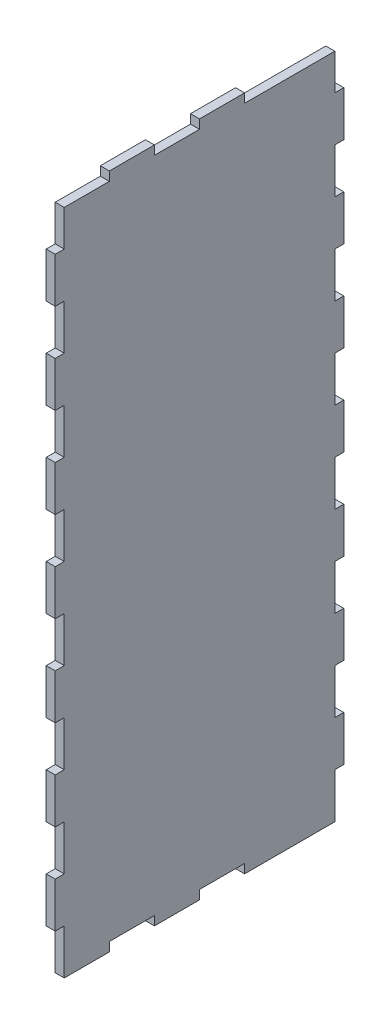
ISO-10303-21;
HEADER;
FILE_DESCRIPTION(('STEP AP214'),'2;1');
FILE_NAME('part.step','',(''),(''),'','','');
FILE_SCHEMA(('AUTOMOTIVE_DESIGN { 1 0 10303 214 1 1 1 1 }'));
ENDSEC;
DATA;
#1=APPLICATION_CONTEXT('core data for automotive mechanical design processes');
#2=APPLICATION_PROTOCOL_DEFINITION('international standard','automotive_design',2000,#1);
#3=PRODUCT_CONTEXT('',#1,'mechanical');
#4=PRODUCT('Part','Part','',(#3));
#5=PRODUCT_RELATED_PRODUCT_CATEGORY('part','',(#4));
#6=PRODUCT_DEFINITION_FORMATION('','',#4);
#7=PRODUCT_DEFINITION_CONTEXT('part definition',#1,'design');
#8=PRODUCT_DEFINITION('design','',#6,#7);
#9=PRODUCT_DEFINITION_SHAPE('','',#8);
#10=(LENGTH_UNIT() NAMED_UNIT(*) SI_UNIT(.MILLI.,.METRE.));
#11=(NAMED_UNIT(*) PLANE_ANGLE_UNIT() SI_UNIT($,.RADIAN.));
#12=(NAMED_UNIT(*) SI_UNIT($,.STERADIAN.) SOLID_ANGLE_UNIT());
#13=UNCERTAINTY_MEASURE_WITH_UNIT(LENGTH_MEASURE(1.E-05),#10,'distance_accuracy_value','');
#14=(GEOMETRIC_REPRESENTATION_CONTEXT(3) GLOBAL_UNCERTAINTY_ASSIGNED_CONTEXT((#13)) GLOBAL_UNIT_ASSIGNED_CONTEXT((#10,
#11,#12)) REPRESENTATION_CONTEXT('',''));
#15=CARTESIAN_POINT('',(0.,0.,0.));
#16=DIRECTION('',(0.,0.,1.));
#17=DIRECTION('',(1.,0.,0.));
#18=AXIS2_PLACEMENT_3D('',#15,#16,#17);
#19=CARTESIAN_POINT('',(0.,0.,0.));
#20=DIRECTION('',(0.,0.,1.));
#21=DIRECTION('',(1.,0.,0.));
#22=AXIS2_PLACEMENT_3D('',#19,#20,#21);
#23=PLANE('',#22);
#24=DIRECTION('',(1.,0.,0.));
#25=VECTOR('',#24,1.);
#26=CARTESIAN_POINT('',(75.,65.,0.));
#27=LINE('',#26,#25);
#28=CARTESIAN_POINT('',(73.,65.,0.));
#29=VERTEX_POINT('',#28);
#30=CARTESIAN_POINT('',(75.,65.,0.));
#31=VERTEX_POINT('',#30);
#32=EDGE_CURVE('E531',#29,#31,#27,.T.);
#33=ORIENTED_EDGE('',*,*,#32,.F.);
#34=DIRECTION('',(0.,-1.,0.));
#35=VECTOR('',#34,1.);
#36=CARTESIAN_POINT('',(73.,-75.,0.));
#37=LINE('',#36,#35);
#38=CARTESIAN_POINT('',(73.,73.,0.));
#39=VERTEX_POINT('',#38);
#40=EDGE_CURVE('E993',#39,#29,#37,.T.);
#41=ORIENTED_EDGE('',*,*,#40,.F.);
#42=DIRECTION('',(-1.,0.,0.));
#43=VECTOR('',#42,1.);
#44=CARTESIAN_POINT('',(75.,73.,0.));
#45=LINE('',#44,#43);
#46=CARTESIAN_POINT('',(75.,73.,0.));
#47=VERTEX_POINT('',#46);
#48=EDGE_CURVE('E988',#47,#39,#45,.T.);
#49=ORIENTED_EDGE('',*,*,#48,.F.);
#50=DIRECTION('',(0.,1.,0.));
#51=VECTOR('',#50,1.);
#52=CARTESIAN_POINT('',(75.,-75.,0.));
#53=LINE('',#52,#51);
#54=EDGE_CURVE('E965',#31,#47,#53,.T.);
#55=ORIENTED_EDGE('',*,*,#54,.F.);
#56=EDGE_LOOP('',(#33,#41,#49,#55));
#57=FACE_BOUND('',#56,.T.);
#58=ADVANCED_FACE('F35',(#57),#23,.F.);
#59=DIRECTION('',(-1.,0.,0.));
#60=VECTOR('',#59,1.);
#61=CARTESIAN_POINT('',(73.,55.,0.));
#62=LINE('',#61,#60);
#63=CARTESIAN_POINT('',(75.,55.,0.));
#64=VERTEX_POINT('',#63);
#65=CARTESIAN_POINT('',(73.,55.,0.));
#66=VERTEX_POINT('',#65);
#67=EDGE_CURVE('E527',#64,#66,#62,.T.);
#68=ORIENTED_EDGE('',*,*,#67,.F.);
#69=CARTESIAN_POINT('',(75.,45.,0.));
#70=VERTEX_POINT('',#69);
#71=EDGE_CURVE('E1099',#70,#64,#53,.T.);
#72=ORIENTED_EDGE('',*,*,#71,.F.);
#73=DIRECTION('',(1.,0.,0.));
#74=VECTOR('',#73,1.);
#75=CARTESIAN_POINT('',(75.,45.,0.));
#76=LINE('',#75,#74);
#77=CARTESIAN_POINT('',(73.,45.,0.));
#78=VERTEX_POINT('',#77);
#79=EDGE_CURVE('E533',#78,#70,#76,.T.);
#80=ORIENTED_EDGE('',*,*,#79,.F.);
#81=EDGE_CURVE('E997',#66,#78,#37,.T.);
#82=ORIENTED_EDGE('',*,*,#81,.F.);
#83=EDGE_LOOP('',(#68,#72,#80,#82));
#84=FACE_BOUND('',#83,.T.);
#85=ADVANCED_FACE('F1039',(#84),#23,.F.);
#86=DIRECTION('',(-1.,0.,0.));
#87=VECTOR('',#86,1.);
#88=CARTESIAN_POINT('',(73.,35.,0.));
#89=LINE('',#88,#87);
#90=CARTESIAN_POINT('',(75.,35.,0.));
#91=VERTEX_POINT('',#90);
#92=CARTESIAN_POINT('',(73.,35.,0.));
#93=VERTEX_POINT('',#92);
#94=EDGE_CURVE('E536',#91,#93,#89,.T.);
#95=ORIENTED_EDGE('',*,*,#94,.F.);
#96=CARTESIAN_POINT('',(75.,25.,0.));
#97=VERTEX_POINT('',#96);
#98=EDGE_CURVE('E1095',#97,#91,#53,.T.);
#99=ORIENTED_EDGE('',*,*,#98,.F.);
#100=DIRECTION('',(1.,0.,0.));
#101=VECTOR('',#100,1.);
#102=CARTESIAN_POINT('',(75.,25.,0.));
#103=LINE('',#102,#101);
#104=CARTESIAN_POINT('',(73.,25.,0.));
#105=VERTEX_POINT('',#104);
#106=EDGE_CURVE('E559',#105,#97,#103,.T.);
#107=ORIENTED_EDGE('',*,*,#106,.F.);
#108=EDGE_CURVE('E1041',#93,#105,#37,.T.);
#109=ORIENTED_EDGE('',*,*,#108,.F.);
#110=EDGE_LOOP('',(#95,#99,#107,#109));
#111=FACE_BOUND('',#110,.T.);
#112=ADVANCED_FACE('F1229',(#111),#23,.F.);
#113=DIRECTION('',(-1.,0.,0.));
#114=VECTOR('',#113,1.);
#115=CARTESIAN_POINT('',(73.,15.,0.));
#116=LINE('',#115,#114);
#117=CARTESIAN_POINT('',(75.,15.,0.));
#118=VERTEX_POINT('',#117);
#119=CARTESIAN_POINT('',(73.,15.,0.));
#120=VERTEX_POINT('',#119);
#121=EDGE_CURVE('E564',#118,#120,#116,.T.);
#122=ORIENTED_EDGE('',*,*,#121,.F.);
#123=CARTESIAN_POINT('',(75.,5.00000000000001,0.));
#124=VERTEX_POINT('',#123);
#125=EDGE_CURVE('E1091',#124,#118,#53,.T.);
#126=ORIENTED_EDGE('',*,*,#125,.F.);
#127=DIRECTION('',(1.,0.,0.));
#128=VECTOR('',#127,1.);
#129=CARTESIAN_POINT('',(75.,5.00000000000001,0.));
#130=LINE('',#129,#128);
#131=CARTESIAN_POINT('',(73.,5.00000000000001,0.));
#132=VERTEX_POINT('',#131);
#133=EDGE_CURVE('E583',#132,#124,#130,.T.);
#134=ORIENTED_EDGE('',*,*,#133,.F.);
#135=EDGE_CURVE('E1042',#120,#132,#37,.T.);
#136=ORIENTED_EDGE('',*,*,#135,.F.);
#137=EDGE_LOOP('',(#122,#126,#134,#136));
#138=FACE_BOUND('',#137,.T.);
#139=ADVANCED_FACE('F1247',(#138),#23,.F.);
#140=DIRECTION('',(-1.,0.,0.));
#141=VECTOR('',#140,1.);
#142=CARTESIAN_POINT('',(73.,-4.99999999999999,0.));
#143=LINE('',#142,#141);
#144=CARTESIAN_POINT('',(75.,-4.99999999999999,0.));
#145=VERTEX_POINT('',#144);
#146=CARTESIAN_POINT('',(73.,-4.99999999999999,0.));
#147=VERTEX_POINT('',#146);
#148=EDGE_CURVE('E588',#145,#147,#143,.T.);
#149=ORIENTED_EDGE('',*,*,#148,.F.);
#150=CARTESIAN_POINT('',(75.,-15.,0.));
#151=VERTEX_POINT('',#150);
#152=EDGE_CURVE('E1087',#151,#145,#53,.T.);
#153=ORIENTED_EDGE('',*,*,#152,.F.);
#154=DIRECTION('',(1.,0.,0.));
#155=VECTOR('',#154,1.);
#156=CARTESIAN_POINT('',(75.,-15.,0.));
#157=LINE('',#156,#155);
#158=CARTESIAN_POINT('',(73.,-15.,0.));
#159=VERTEX_POINT('',#158);
#160=EDGE_CURVE('E607',#159,#151,#157,.T.);
#161=ORIENTED_EDGE('',*,*,#160,.F.);
#162=EDGE_CURVE('E1045',#147,#159,#37,.T.);
#163=ORIENTED_EDGE('',*,*,#162,.F.);
#164=EDGE_LOOP('',(#149,#153,#161,#163));
#165=FACE_BOUND('',#164,.T.);
#166=ADVANCED_FACE('F1242',(#165),#23,.F.);
#167=DIRECTION('',(-1.,0.,0.));
#168=VECTOR('',#167,1.);
#169=CARTESIAN_POINT('',(73.,-25.,0.));
#170=LINE('',#169,#168);
#171=CARTESIAN_POINT('',(75.,-25.,0.));
#172=VERTEX_POINT('',#171);
#173=CARTESIAN_POINT('',(73.,-25.,0.));
#174=VERTEX_POINT('',#173);
#175=EDGE_CURVE('E612',#172,#174,#170,.T.);
#176=ORIENTED_EDGE('',*,*,#175,.F.);
#177=CARTESIAN_POINT('',(75.,-35.,0.));
#178=VERTEX_POINT('',#177);
#179=EDGE_CURVE('E1085',#178,#172,#53,.T.);
#180=ORIENTED_EDGE('',*,*,#179,.F.);
#181=DIRECTION('',(1.,0.,0.));
#182=VECTOR('',#181,1.);
#183=CARTESIAN_POINT('',(75.,-35.,0.));
#184=LINE('',#183,#182);
#185=CARTESIAN_POINT('',(73.,-35.,0.));
#186=VERTEX_POINT('',#185);
#187=EDGE_CURVE('E631',#186,#178,#184,.T.);
#188=ORIENTED_EDGE('',*,*,#187,.F.);
#189=EDGE_CURVE('E1048',#174,#186,#37,.T.);
#190=ORIENTED_EDGE('',*,*,#189,.F.);
#191=EDGE_LOOP('',(#176,#180,#188,#190));
#192=FACE_BOUND('',#191,.T.);
#193=ADVANCED_FACE('F1238',(#192),#23,.F.);
#194=DIRECTION('',(-1.,0.,0.));
#195=VECTOR('',#194,1.);
#196=CARTESIAN_POINT('',(73.,-45.,0.));
#197=LINE('',#196,#195);
#198=CARTESIAN_POINT('',(75.,-45.,0.));
#199=VERTEX_POINT('',#198);
#200=CARTESIAN_POINT('',(73.,-45.,0.));
#201=VERTEX_POINT('',#200);
#202=EDGE_CURVE('E636',#199,#201,#197,.T.);
#203=ORIENTED_EDGE('',*,*,#202,.F.);
#204=CARTESIAN_POINT('',(75.,-55.,0.));
#205=VERTEX_POINT('',#204);
#206=EDGE_CURVE('E989',#205,#199,#53,.T.);
#207=ORIENTED_EDGE('',*,*,#206,.F.);
#208=DIRECTION('',(1.,0.,0.));
#209=VECTOR('',#208,1.);
#210=CARTESIAN_POINT('',(75.,-55.,0.));
#211=LINE('',#210,#209);
#212=CARTESIAN_POINT('',(73.,-55.,0.));
#213=VERTEX_POINT('',#212);
#214=EDGE_CURVE('E655',#213,#205,#211,.T.);
#215=ORIENTED_EDGE('',*,*,#214,.F.);
#216=EDGE_CURVE('E1051',#201,#213,#37,.T.);
#217=ORIENTED_EDGE('',*,*,#216,.F.);
#218=EDGE_LOOP('',(#203,#207,#215,#217));
#219=FACE_BOUND('',#218,.T.);
#220=ADVANCED_FACE('F1084',(#219),#23,.F.);
#221=DIRECTION('',(-1.,0.,0.));
#222=VECTOR('',#221,1.);
#223=CARTESIAN_POINT('',(73.,-65.,0.));
#224=LINE('',#223,#222);
#225=CARTESIAN_POINT('',(75.,-65.,0.));
#226=VERTEX_POINT('',#225);
#227=CARTESIAN_POINT('',(73.,-65.,0.));
#228=VERTEX_POINT('',#227);
#229=EDGE_CURVE('E660',#226,#228,#224,.T.);
#230=ORIENTED_EDGE('',*,*,#229,.F.);
#231=CARTESIAN_POINT('',(75.,-75.,0.));
#232=VERTEX_POINT('',#231);
#233=EDGE_CURVE('E985',#232,#226,#53,.T.);
#234=ORIENTED_EDGE('',*,*,#233,.F.);
#235=DIRECTION('',(1.,0.,0.));
#236=VECTOR('',#235,1.);
#237=CARTESIAN_POINT('',(75.,-75.,0.));
#238=LINE('',#237,#236);
#239=CARTESIAN_POINT('',(73.,-75.,0.));
#240=VERTEX_POINT('',#239);
#241=EDGE_CURVE('E996',#240,#232,#238,.T.);
#242=ORIENTED_EDGE('',*,*,#241,.F.);
#243=EDGE_CURVE('E992',#228,#240,#37,.T.);
#244=ORIENTED_EDGE('',*,*,#243,.F.);
#245=EDGE_LOOP('',(#230,#234,#242,#244));
#246=FACE_BOUND('',#245,.T.);
#247=ADVANCED_FACE('F1069',(#246),#23,.F.);
#248=CARTESIAN_POINT('',(0.,0.,60.));
#249=DIRECTION('',(0.,0.,1.));
#250=DIRECTION('',(1.,0.,0.));
#251=AXIS2_PLACEMENT_3D('',#248,#249,#250);
#252=PLANE('',#251);
#253=DIRECTION('',(0.,1.,0.));
#254=VECTOR('',#253,1.);
#255=CARTESIAN_POINT('',(75.,-75.,60.));
#256=LINE('',#255,#254);
#257=CARTESIAN_POINT('',(75.,45.,60.));
#258=VERTEX_POINT('',#257);
#259=CARTESIAN_POINT('',(75.,55.,60.));
#260=VERTEX_POINT('',#259);
#261=EDGE_CURVE('E1141',#258,#260,#256,.T.);
#262=ORIENTED_EDGE('',*,*,#261,.T.);
#263=DIRECTION('',(1.,0.,0.));
#264=VECTOR('',#263,1.);
#265=CARTESIAN_POINT('',(73.,55.,60.));
#266=LINE('',#265,#264);
#267=CARTESIAN_POINT('',(73.,55.,60.));
#268=VERTEX_POINT('',#267);
#269=EDGE_CURVE('E682',#268,#260,#266,.T.);
#270=ORIENTED_EDGE('',*,*,#269,.F.);
#271=DIRECTION('',(0.,-1.,0.));
#272=VECTOR('',#271,1.);
#273=CARTESIAN_POINT('',(73.,-75.,60.));
#274=LINE('',#273,#272);
#275=CARTESIAN_POINT('',(73.,45.,60.));
#276=VERTEX_POINT('',#275);
#277=EDGE_CURVE('E982',#268,#276,#274,.T.);
#278=ORIENTED_EDGE('',*,*,#277,.T.);
#279=DIRECTION('',(-1.,0.,0.));
#280=VECTOR('',#279,1.);
#281=CARTESIAN_POINT('',(73.,45.,60.));
#282=LINE('',#281,#280);
#283=EDGE_CURVE('E714',#258,#276,#282,.T.);
#284=ORIENTED_EDGE('',*,*,#283,.F.);
#285=EDGE_LOOP('',(#262,#270,#278,#284));
#286=FACE_BOUND('',#285,.T.);
#287=ADVANCED_FACE('F1156',(#286),#252,.T.);
#288=CARTESIAN_POINT('',(73.,73.,60.));
#289=VERTEX_POINT('',#288);
#290=CARTESIAN_POINT('',(73.,65.,60.));
#291=VERTEX_POINT('',#290);
#292=EDGE_CURVE('E979',#289,#291,#274,.T.);
#293=ORIENTED_EDGE('',*,*,#292,.T.);
#294=DIRECTION('',(-1.,0.,0.));
#295=VECTOR('',#294,1.);
#296=CARTESIAN_POINT('',(73.,65.,60.));
#297=LINE('',#296,#295);
#298=CARTESIAN_POINT('',(75.,65.,60.));
#299=VERTEX_POINT('',#298);
#300=EDGE_CURVE('E687',#299,#291,#297,.T.);
#301=ORIENTED_EDGE('',*,*,#300,.F.);
#302=CARTESIAN_POINT('',(75.,73.,60.));
#303=VERTEX_POINT('',#302);
#304=EDGE_CURVE('E976',#299,#303,#256,.T.);
#305=ORIENTED_EDGE('',*,*,#304,.T.);
#306=DIRECTION('',(-1.,0.,0.));
#307=VECTOR('',#306,1.);
#308=CARTESIAN_POINT('',(75.,73.,60.));
#309=LINE('',#308,#307);
#310=EDGE_CURVE('E974',#303,#289,#309,.T.);
#311=ORIENTED_EDGE('',*,*,#310,.T.);
#312=EDGE_LOOP('',(#293,#301,#305,#311));
#313=FACE_BOUND('',#312,.T.);
#314=ADVANCED_FACE('F1237',(#313),#252,.T.);
#315=CARTESIAN_POINT('',(75.,25.,60.));
#316=VERTEX_POINT('',#315);
#317=CARTESIAN_POINT('',(75.,35.,60.));
#318=VERTEX_POINT('',#317);
#319=EDGE_CURVE('E1157',#316,#318,#256,.T.);
#320=ORIENTED_EDGE('',*,*,#319,.T.);
#321=DIRECTION('',(1.,0.,0.));
#322=VECTOR('',#321,1.);
#323=CARTESIAN_POINT('',(73.,35.,60.));
#324=LINE('',#323,#322);
#325=CARTESIAN_POINT('',(73.,35.,60.));
#326=VERTEX_POINT('',#325);
#327=EDGE_CURVE('E709',#326,#318,#324,.T.);
#328=ORIENTED_EDGE('',*,*,#327,.F.);
#329=CARTESIAN_POINT('',(73.,25.,60.));
#330=VERTEX_POINT('',#329);
#331=EDGE_CURVE('E2008',#326,#330,#274,.T.);
#332=ORIENTED_EDGE('',*,*,#331,.T.);
#333=DIRECTION('',(-1.,0.,0.));
#334=VECTOR('',#333,1.);
#335=CARTESIAN_POINT('',(73.,25.,60.));
#336=LINE('',#335,#334);
#337=EDGE_CURVE('E741',#316,#330,#336,.T.);
#338=ORIENTED_EDGE('',*,*,#337,.F.);
#339=EDGE_LOOP('',(#320,#328,#332,#338));
#340=FACE_BOUND('',#339,.T.);
#341=ADVANCED_FACE('F1807',(#340),#252,.T.);
#342=CARTESIAN_POINT('',(75.,5.,60.));
#343=VERTEX_POINT('',#342);
#344=CARTESIAN_POINT('',(75.,15.,60.));
#345=VERTEX_POINT('',#344);
#346=EDGE_CURVE('E1158',#343,#345,#256,.T.);
#347=ORIENTED_EDGE('',*,*,#346,.T.);
#348=DIRECTION('',(1.,0.,0.));
#349=VECTOR('',#348,1.);
#350=CARTESIAN_POINT('',(73.,15.,60.));
#351=LINE('',#350,#349);
#352=CARTESIAN_POINT('',(73.,15.,60.));
#353=VERTEX_POINT('',#352);
#354=EDGE_CURVE('E736',#353,#345,#351,.T.);
#355=ORIENTED_EDGE('',*,*,#354,.F.);
#356=CARTESIAN_POINT('',(73.,5.,60.));
#357=VERTEX_POINT('',#356);
#358=EDGE_CURVE('E2009',#353,#357,#274,.T.);
#359=ORIENTED_EDGE('',*,*,#358,.T.);
#360=DIRECTION('',(-1.,0.,0.));
#361=VECTOR('',#360,1.);
#362=CARTESIAN_POINT('',(73.,5.00000000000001,60.));
#363=LINE('',#362,#361);
#364=EDGE_CURVE('E768',#343,#357,#363,.T.);
#365=ORIENTED_EDGE('',*,*,#364,.F.);
#366=EDGE_LOOP('',(#347,#355,#359,#365));
#367=FACE_BOUND('',#366,.T.);
#368=ADVANCED_FACE('F1800',(#367),#252,.T.);
#369=CARTESIAN_POINT('',(75.,-15.,60.));
#370=VERTEX_POINT('',#369);
#371=CARTESIAN_POINT('',(75.,-4.99999999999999,60.));
#372=VERTEX_POINT('',#371);
#373=EDGE_CURVE('E1162',#370,#372,#256,.T.);
#374=ORIENTED_EDGE('',*,*,#373,.T.);
#375=DIRECTION('',(1.,0.,0.));
#376=VECTOR('',#375,1.);
#377=CARTESIAN_POINT('',(73.,-4.99999999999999,60.));
#378=LINE('',#377,#376);
#379=CARTESIAN_POINT('',(73.,-4.99999999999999,60.));
#380=VERTEX_POINT('',#379);
#381=EDGE_CURVE('E763',#380,#372,#378,.T.);
#382=ORIENTED_EDGE('',*,*,#381,.F.);
#383=CARTESIAN_POINT('',(73.,-15.,60.));
#384=VERTEX_POINT('',#383);
#385=EDGE_CURVE('E1193',#380,#384,#274,.T.);
#386=ORIENTED_EDGE('',*,*,#385,.T.);
#387=DIRECTION('',(-1.,0.,0.));
#388=VECTOR('',#387,1.);
#389=CARTESIAN_POINT('',(73.,-15.,60.));
#390=LINE('',#389,#388);
#391=EDGE_CURVE('E795',#370,#384,#390,.T.);
#392=ORIENTED_EDGE('',*,*,#391,.F.);
#393=EDGE_LOOP('',(#374,#382,#386,#392));
#394=FACE_BOUND('',#393,.T.);
#395=ADVANCED_FACE('F1793',(#394),#252,.T.);
#396=CARTESIAN_POINT('',(75.,-35.,60.));
#397=VERTEX_POINT('',#396);
#398=CARTESIAN_POINT('',(75.,-25.,60.));
#399=VERTEX_POINT('',#398);
#400=EDGE_CURVE('E1166',#397,#399,#256,.T.);
#401=ORIENTED_EDGE('',*,*,#400,.T.);
#402=DIRECTION('',(1.,0.,0.));
#403=VECTOR('',#402,1.);
#404=CARTESIAN_POINT('',(73.,-25.,60.));
#405=LINE('',#404,#403);
#406=CARTESIAN_POINT('',(73.,-25.,60.));
#407=VERTEX_POINT('',#406);
#408=EDGE_CURVE('E790',#407,#399,#405,.T.);
#409=ORIENTED_EDGE('',*,*,#408,.F.);
#410=CARTESIAN_POINT('',(73.,-35.,60.));
#411=VERTEX_POINT('',#410);
#412=EDGE_CURVE('E1192',#407,#411,#274,.T.);
#413=ORIENTED_EDGE('',*,*,#412,.T.);
#414=DIRECTION('',(-1.,0.,0.));
#415=VECTOR('',#414,1.);
#416=CARTESIAN_POINT('',(73.,-35.,60.));
#417=LINE('',#416,#415);
#418=EDGE_CURVE('E822',#397,#411,#417,.T.);
#419=ORIENTED_EDGE('',*,*,#418,.F.);
#420=EDGE_LOOP('',(#401,#409,#413,#419));
#421=FACE_BOUND('',#420,.T.);
#422=ADVANCED_FACE('F1786',(#421),#252,.T.);
#423=CARTESIAN_POINT('',(75.,-55.,60.));
#424=VERTEX_POINT('',#423);
#425=CARTESIAN_POINT('',(75.,-45.,60.));
#426=VERTEX_POINT('',#425);
#427=EDGE_CURVE('E975',#424,#426,#256,.T.);
#428=ORIENTED_EDGE('',*,*,#427,.T.);
#429=DIRECTION('',(1.,0.,0.));
#430=VECTOR('',#429,1.);
#431=CARTESIAN_POINT('',(73.,-45.,60.));
#432=LINE('',#431,#430);
#433=CARTESIAN_POINT('',(73.,-45.,60.));
#434=VERTEX_POINT('',#433);
#435=EDGE_CURVE('E817',#434,#426,#432,.T.);
#436=ORIENTED_EDGE('',*,*,#435,.F.);
#437=CARTESIAN_POINT('',(73.,-55.,60.));
#438=VERTEX_POINT('',#437);
#439=EDGE_CURVE('E1189',#434,#438,#274,.T.);
#440=ORIENTED_EDGE('',*,*,#439,.T.);
#441=DIRECTION('',(-1.,0.,0.));
#442=VECTOR('',#441,1.);
#443=CARTESIAN_POINT('',(73.,-55.,60.));
#444=LINE('',#443,#442);
#445=EDGE_CURVE('E849',#424,#438,#444,.T.);
#446=ORIENTED_EDGE('',*,*,#445,.F.);
#447=EDGE_LOOP('',(#428,#436,#440,#446));
#448=FACE_BOUND('',#447,.T.);
#449=ADVANCED_FACE('F1176',(#448),#252,.T.);
#450=CARTESIAN_POINT('',(75.,73.,60.));
#451=DIRECTION('',(0.,-1.,0.));
#452=DIRECTION('',(1.,0.,0.));
#453=AXIS2_PLACEMENT_3D('',#450,#451,#452);
#454=PLANE('',#453);
#455=DIRECTION('',(1.,0.,0.));
#456=VECTOR('',#455,1.);
#457=CARTESIAN_POINT('',(75.,73.0000000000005,50.));
#458=LINE('',#457,#456);
#459=CARTESIAN_POINT('',(73.,73.0000000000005,50.));
#460=VERTEX_POINT('',#459);
#461=CARTESIAN_POINT('',(75.,73.0000000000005,50.));
#462=VERTEX_POINT('',#461);
#463=EDGE_CURVE('E871',#460,#462,#458,.T.);
#464=ORIENTED_EDGE('',*,*,#463,.F.);
#465=DIRECTION('',(0.,0.,-1.));
#466=VECTOR('',#465,1.);
#467=CARTESIAN_POINT('',(73.,73.,60.));
#468=LINE('',#467,#466);
#469=EDGE_CURVE('E1009',#289,#460,#468,.T.);
#470=ORIENTED_EDGE('',*,*,#469,.F.);
#471=ORIENTED_EDGE('',*,*,#310,.F.);
#472=DIRECTION('',(0.,0.,-1.));
#473=VECTOR('',#472,1.);
#474=CARTESIAN_POINT('',(75.,73.,60.));
#475=LINE('',#474,#473);
#476=EDGE_CURVE('E11',#303,#462,#475,.T.);
#477=ORIENTED_EDGE('',*,*,#476,.T.);
#478=EDGE_LOOP('',(#464,#470,#471,#477));
#479=FACE_BOUND('',#478,.T.);
#480=ADVANCED_FACE('F1134',(#479),#454,.F.);
#481=DIRECTION('',(-1.,0.,0.));
#482=VECTOR('',#481,1.);
#483=CARTESIAN_POINT('',(73.,73.0000000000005,40.));
#484=LINE('',#483,#482);
#485=CARTESIAN_POINT('',(75.,73.0000000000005,40.));
#486=VERTEX_POINT('',#485);
#487=CARTESIAN_POINT('',(73.,73.,40.));
#488=VERTEX_POINT('',#487);
#489=EDGE_CURVE('E876',#486,#488,#484,.T.);
#490=ORIENTED_EDGE('',*,*,#489,.F.);
#491=CARTESIAN_POINT('',(75.,73.,30.));
#492=VERTEX_POINT('',#491);
#493=EDGE_CURVE('E43',#486,#492,#475,.T.);
#494=ORIENTED_EDGE('',*,*,#493,.T.);
#495=DIRECTION('',(1.,0.,0.));
#496=VECTOR('',#495,1.);
#497=CARTESIAN_POINT('',(75.,73.0000000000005,30.));
#498=LINE('',#497,#496);
#499=CARTESIAN_POINT('',(73.,73.,30.));
#500=VERTEX_POINT('',#499);
#501=EDGE_CURVE('E899',#500,#492,#498,.T.);
#502=ORIENTED_EDGE('',*,*,#501,.F.);
#503=EDGE_CURVE('E1011',#488,#500,#468,.T.);
#504=ORIENTED_EDGE('',*,*,#503,.F.);
#505=EDGE_LOOP('',(#490,#494,#502,#504));
#506=FACE_BOUND('',#505,.T.);
#507=ADVANCED_FACE('F1119',(#506),#454,.F.);
#508=DIRECTION('',(-1.,0.,0.));
#509=VECTOR('',#508,1.);
#510=CARTESIAN_POINT('',(73.,73.0000000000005,20.));
#511=LINE('',#510,#509);
#512=CARTESIAN_POINT('',(75.,73.,20.));
#513=VERTEX_POINT('',#512);
#514=CARTESIAN_POINT('',(73.,73.0000000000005,20.));
#515=VERTEX_POINT('',#514);
#516=EDGE_CURVE('E894',#513,#515,#511,.T.);
#517=ORIENTED_EDGE('',*,*,#516,.F.);
#518=EDGE_CURVE('E44',#513,#47,#475,.T.);
#519=ORIENTED_EDGE('',*,*,#518,.T.);
#520=ORIENTED_EDGE('',*,*,#48,.T.);
#521=EDGE_CURVE('E1007',#515,#39,#468,.T.);
#522=ORIENTED_EDGE('',*,*,#521,.F.);
#523=EDGE_LOOP('',(#517,#519,#520,#522));
#524=FACE_BOUND('',#523,.T.);
#525=ADVANCED_FACE('F1023',(#524),#454,.F.);
#526=CARTESIAN_POINT('',(75.,-75.,60.));
#527=DIRECTION('',(0.,1.,0.));
#528=DIRECTION('',(0.,0.,1.));
#529=AXIS2_PLACEMENT_3D('',#526,#527,#528);
#530=PLANE('',#529);
#531=DIRECTION('',(0.,0.,-1.));
#532=VECTOR('',#531,1.);
#533=CARTESIAN_POINT('',(73.,-75.,60.));
#534=LINE('',#533,#532);
#535=CARTESIAN_POINT('',(73.,-75.,40.));
#536=VERTEX_POINT('',#535);
#537=CARTESIAN_POINT('',(73.,-75.,30.));
#538=VERTEX_POINT('',#537);
#539=EDGE_CURVE('E1008',#536,#538,#534,.T.);
#540=ORIENTED_EDGE('',*,*,#539,.T.);
#541=DIRECTION('',(-1.,0.,0.));
#542=VECTOR('',#541,1.);
#543=CARTESIAN_POINT('',(73.,-75.,30.));
#544=LINE('',#543,#542);
#545=CARTESIAN_POINT('',(75.,-75.,30.));
#546=VERTEX_POINT('',#545);
#547=EDGE_CURVE('E926',#546,#538,#544,.T.);
#548=ORIENTED_EDGE('',*,*,#547,.F.);
#549=DIRECTION('',(0.,0.,-1.));
#550=VECTOR('',#549,1.);
#551=CARTESIAN_POINT('',(75.,-75.,60.));
#552=LINE('',#551,#550);
#553=CARTESIAN_POINT('',(75.,-75.,40.));
#554=VERTEX_POINT('',#553);
#555=EDGE_CURVE('E1004',#554,#546,#552,.T.);
#556=ORIENTED_EDGE('',*,*,#555,.F.);
#557=DIRECTION('',(1.,0.,0.));
#558=VECTOR('',#557,1.);
#559=CARTESIAN_POINT('',(73.,-75.,40.));
#560=LINE('',#559,#558);
#561=EDGE_CURVE('E940',#536,#554,#560,.T.);
#562=ORIENTED_EDGE('',*,*,#561,.F.);
#563=EDGE_LOOP('',(#540,#548,#556,#562));
#564=FACE_BOUND('',#563,.T.);
#565=ADVANCED_FACE('F1842',(#564),#530,.F.);
#566=CARTESIAN_POINT('',(73.,-75.,60.));
#567=VERTEX_POINT('',#566);
#568=CARTESIAN_POINT('',(73.,-75.,50.));
#569=VERTEX_POINT('',#568);
#570=EDGE_CURVE('E1005',#567,#569,#534,.T.);
#571=ORIENTED_EDGE('',*,*,#570,.T.);
#572=DIRECTION('',(-1.,0.,0.));
#573=VECTOR('',#572,1.);
#574=CARTESIAN_POINT('',(73.,-75.,50.));
#575=LINE('',#574,#573);
#576=CARTESIAN_POINT('',(75.,-75.,50.));
#577=VERTEX_POINT('',#576);
#578=EDGE_CURVE('E951',#577,#569,#575,.T.);
#579=ORIENTED_EDGE('',*,*,#578,.F.);
#580=CARTESIAN_POINT('',(75.,-75.,60.));
#581=VERTEX_POINT('',#580);
#582=EDGE_CURVE('E1000',#581,#577,#552,.T.);
#583=ORIENTED_EDGE('',*,*,#582,.F.);
#584=DIRECTION('',(1.,0.,0.));
#585=VECTOR('',#584,1.);
#586=CARTESIAN_POINT('',(75.,-75.,60.));
#587=LINE('',#586,#585);
#588=EDGE_CURVE('E981',#567,#581,#587,.T.);
#589=ORIENTED_EDGE('',*,*,#588,.F.);
#590=EDGE_LOOP('',(#571,#579,#583,#589));
#591=FACE_BOUND('',#590,.T.);
#592=ADVANCED_FACE('F1204',(#591),#530,.F.);
#593=CARTESIAN_POINT('',(75.,-75.,60.));
#594=DIRECTION('',(-1.,0.,0.));
#595=DIRECTION('',(0.,0.,1.));
#596=AXIS2_PLACEMENT_3D('',#593,#594,#595);
#597=PLANE('',#596);
#598=ORIENTED_EDGE('',*,*,#555,.T.);
#599=DIRECTION('',(0.,-1.,0.));
#600=VECTOR('',#599,1.);
#601=CARTESIAN_POINT('',(75.,-73.,30.));
#602=LINE('',#601,#600);
#603=CARTESIAN_POINT('',(75.,-73.,30.));
#604=VERTEX_POINT('',#603);
#605=EDGE_CURVE('E941',#604,#546,#602,.T.);
#606=ORIENTED_EDGE('',*,*,#605,.F.);
#607=DIRECTION('',(0.,0.,1.));
#608=VECTOR('',#607,1.);
#609=CARTESIAN_POINT('',(75.,-73.,30.));
#610=LINE('',#609,#608);
#611=CARTESIAN_POINT('',(75.,-73.,20.));
#612=VERTEX_POINT('',#611);
#613=EDGE_CURVE('E929',#612,#604,#610,.T.);
#614=ORIENTED_EDGE('',*,*,#613,.F.);
#615=DIRECTION('',(0.,-1.,0.));
#616=VECTOR('',#615,1.);
#617=CARTESIAN_POINT('',(75.,-73.,20.));
#618=LINE('',#617,#616);
#619=CARTESIAN_POINT('',(75.,-75.,20.));
#620=VERTEX_POINT('',#619);
#621=EDGE_CURVE('E943',#612,#620,#618,.T.);
#622=ORIENTED_EDGE('',*,*,#621,.T.);
#623=EDGE_CURVE('E984',#620,#232,#552,.T.);
#624=ORIENTED_EDGE('',*,*,#623,.T.);
#625=ORIENTED_EDGE('',*,*,#233,.T.);
#626=DIRECTION('',(0.,0.,1.));
#627=VECTOR('',#626,1.);
#628=CARTESIAN_POINT('',(75.,-65.,-2.));
#629=LINE('',#628,#627);
#630=CARTESIAN_POINT('',(75.,-65.,-2.));
#631=VERTEX_POINT('',#630);
#632=EDGE_CURVE('E676',#631,#226,#629,.T.);
#633=ORIENTED_EDGE('',*,*,#632,.F.);
#634=DIRECTION('',(0.,-1.,0.));
#635=VECTOR('',#634,1.);
#636=CARTESIAN_POINT('',(75.,-65.,-2.));
#637=LINE('',#636,#635);
#638=CARTESIAN_POINT('',(75.,-55.,-2.));
#639=VERTEX_POINT('',#638);
#640=EDGE_CURVE('E659',#639,#631,#637,.T.);
#641=ORIENTED_EDGE('',*,*,#640,.F.);
#642=DIRECTION('',(0.,0.,1.));
#643=VECTOR('',#642,1.);
#644=CARTESIAN_POINT('',(75.,-55.,-2.));
#645=LINE('',#644,#643);
#646=EDGE_CURVE('E679',#639,#205,#645,.T.);
#647=ORIENTED_EDGE('',*,*,#646,.T.);
#648=ORIENTED_EDGE('',*,*,#206,.T.);
#649=DIRECTION('',(0.,0.,1.));
#650=VECTOR('',#649,1.);
#651=CARTESIAN_POINT('',(75.,-45.,-2.));
#652=LINE('',#651,#650);
#653=CARTESIAN_POINT('',(75.,-45.,-2.));
#654=VERTEX_POINT('',#653);
#655=EDGE_CURVE('E651',#654,#199,#652,.T.);
#656=ORIENTED_EDGE('',*,*,#655,.F.);
#657=DIRECTION('',(0.,-1.,0.));
#658=VECTOR('',#657,1.);
#659=CARTESIAN_POINT('',(75.,-45.,-2.));
#660=LINE('',#659,#658);
#661=CARTESIAN_POINT('',(75.,-35.,-2.));
#662=VERTEX_POINT('',#661);
#663=EDGE_CURVE('E635',#662,#654,#660,.T.);
#664=ORIENTED_EDGE('',*,*,#663,.F.);
#665=DIRECTION('',(0.,0.,1.));
#666=VECTOR('',#665,1.);
#667=CARTESIAN_POINT('',(75.,-35.,-2.));
#668=LINE('',#667,#666);
#669=EDGE_CURVE('E653',#662,#178,#668,.T.);
#670=ORIENTED_EDGE('',*,*,#669,.T.);
#671=ORIENTED_EDGE('',*,*,#179,.T.);
#672=DIRECTION('',(0.,0.,1.));
#673=VECTOR('',#672,1.);
#674=CARTESIAN_POINT('',(75.,-25.,-2.));
#675=LINE('',#674,#673);
#676=CARTESIAN_POINT('',(75.,-25.,-2.));
#677=VERTEX_POINT('',#676);
#678=EDGE_CURVE('E627',#677,#172,#675,.T.);
#679=ORIENTED_EDGE('',*,*,#678,.F.);
#680=DIRECTION('',(0.,-1.,0.));
#681=VECTOR('',#680,1.);
#682=CARTESIAN_POINT('',(75.,-25.,-2.));
#683=LINE('',#682,#681);
#684=CARTESIAN_POINT('',(75.,-15.,-2.));
#685=VERTEX_POINT('',#684);
#686=EDGE_CURVE('E611',#685,#677,#683,.T.);
#687=ORIENTED_EDGE('',*,*,#686,.F.);
#688=DIRECTION('',(0.,0.,1.));
#689=VECTOR('',#688,1.);
#690=CARTESIAN_POINT('',(75.,-15.,-2.));
#691=LINE('',#690,#689);
#692=EDGE_CURVE('E629',#685,#151,#691,.T.);
#693=ORIENTED_EDGE('',*,*,#692,.T.);
#694=ORIENTED_EDGE('',*,*,#152,.T.);
#695=DIRECTION('',(0.,0.,1.));
#696=VECTOR('',#695,1.);
#697=CARTESIAN_POINT('',(75.,-4.99999999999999,-2.));
#698=LINE('',#697,#696);
#699=CARTESIAN_POINT('',(75.,-4.99999999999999,-2.));
#700=VERTEX_POINT('',#699);
#701=EDGE_CURVE('E603',#700,#145,#698,.T.);
#702=ORIENTED_EDGE('',*,*,#701,.F.);
#703=DIRECTION('',(0.,-1.,0.));
#704=VECTOR('',#703,1.);
#705=CARTESIAN_POINT('',(75.,-4.99999999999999,-2.));
#706=LINE('',#705,#704);
#707=CARTESIAN_POINT('',(75.,5.00000000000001,-2.));
#708=VERTEX_POINT('',#707);
#709=EDGE_CURVE('E587',#708,#700,#706,.T.);
#710=ORIENTED_EDGE('',*,*,#709,.F.);
#711=DIRECTION('',(0.,0.,1.));
#712=VECTOR('',#711,1.);
#713=CARTESIAN_POINT('',(75.,5.00000000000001,-2.));
#714=LINE('',#713,#712);
#715=EDGE_CURVE('E605',#708,#124,#714,.T.);
#716=ORIENTED_EDGE('',*,*,#715,.T.);
#717=ORIENTED_EDGE('',*,*,#125,.T.);
#718=DIRECTION('',(0.,0.,1.));
#719=VECTOR('',#718,1.);
#720=CARTESIAN_POINT('',(75.,15.,-2.));
#721=LINE('',#720,#719);
#722=CARTESIAN_POINT('',(75.,15.,-2.));
#723=VERTEX_POINT('',#722);
#724=EDGE_CURVE('E579',#723,#118,#721,.T.);
#725=ORIENTED_EDGE('',*,*,#724,.F.);
#726=DIRECTION('',(0.,-1.,0.));
#727=VECTOR('',#726,1.);
#728=CARTESIAN_POINT('',(75.,15.,-2.));
#729=LINE('',#728,#727);
#730=CARTESIAN_POINT('',(75.,25.,-2.));
#731=VERTEX_POINT('',#730);
#732=EDGE_CURVE('E563',#731,#723,#729,.T.);
#733=ORIENTED_EDGE('',*,*,#732,.F.);
#734=DIRECTION('',(0.,0.,1.));
#735=VECTOR('',#734,1.);
#736=CARTESIAN_POINT('',(75.,25.,-2.));
#737=LINE('',#736,#735);
#738=EDGE_CURVE('E581',#731,#97,#737,.T.);
#739=ORIENTED_EDGE('',*,*,#738,.T.);
#740=ORIENTED_EDGE('',*,*,#98,.T.);
#741=DIRECTION('',(0.,0.,1.));
#742=VECTOR('',#741,1.);
#743=CARTESIAN_POINT('',(75.,35.,-2.));
#744=LINE('',#743,#742);
#745=CARTESIAN_POINT('',(75.,35.,-2.));
#746=VERTEX_POINT('',#745);
#747=EDGE_CURVE('E555',#746,#91,#744,.T.);
#748=ORIENTED_EDGE('',*,*,#747,.F.);
#749=DIRECTION('',(0.,-1.,0.));
#750=VECTOR('',#749,1.);
#751=CARTESIAN_POINT('',(75.,35.,-2.));
#752=LINE('',#751,#750);
#753=CARTESIAN_POINT('',(75.,45.,-2.));
#754=VERTEX_POINT('',#753);
#755=EDGE_CURVE('E544',#754,#746,#752,.T.);
#756=ORIENTED_EDGE('',*,*,#755,.F.);
#757=DIRECTION('',(0.,0.,1.));
#758=VECTOR('',#757,1.);
#759=CARTESIAN_POINT('',(75.,45.,-2.));
#760=LINE('',#759,#758);
#761=EDGE_CURVE('E557',#754,#70,#760,.T.);
#762=ORIENTED_EDGE('',*,*,#761,.T.);
#763=ORIENTED_EDGE('',*,*,#71,.T.);
#764=DIRECTION('',(0.,0.,1.));
#765=VECTOR('',#764,1.);
#766=CARTESIAN_POINT('',(75.,55.,-2.));
#767=LINE('',#766,#765);
#768=CARTESIAN_POINT('',(75.,55.,-2.));
#769=VERTEX_POINT('',#768);
#770=EDGE_CURVE('E516',#769,#64,#767,.T.);
#771=ORIENTED_EDGE('',*,*,#770,.F.);
#772=DIRECTION('',(0.,-1.,0.));
#773=VECTOR('',#772,1.);
#774=CARTESIAN_POINT('',(75.,55.,-2.));
#775=LINE('',#774,#773);
#776=CARTESIAN_POINT('',(75.,65.,-2.));
#777=VERTEX_POINT('',#776);
#778=EDGE_CURVE('E509',#777,#769,#775,.T.);
#779=ORIENTED_EDGE('',*,*,#778,.F.);
#780=DIRECTION('',(0.,0.,1.));
#781=VECTOR('',#780,1.);
#782=CARTESIAN_POINT('',(75.,65.,-2.));
#783=LINE('',#782,#781);
#784=EDGE_CURVE('E513',#777,#31,#783,.T.);
#785=ORIENTED_EDGE('',*,*,#784,.T.);
#786=ORIENTED_EDGE('',*,*,#54,.T.);
#787=ORIENTED_EDGE('',*,*,#518,.F.);
#788=DIRECTION('',(0.,-1.,0.));
#789=VECTOR('',#788,1.);
#790=CARTESIAN_POINT('',(75.,75.0000000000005,20.));
#791=LINE('',#790,#789);
#792=CARTESIAN_POINT('',(75.,75.0000000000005,20.));
#793=VERTEX_POINT('',#792);
#794=EDGE_CURVE('E918',#793,#513,#791,.T.);
#795=ORIENTED_EDGE('',*,*,#794,.F.);
#796=DIRECTION('',(0.,0.,-1.));
#797=VECTOR('',#796,1.);
#798=CARTESIAN_POINT('',(75.,75.0000000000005,20.));
#799=LINE('',#798,#797);
#800=CARTESIAN_POINT('',(75.,75.0000000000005,30.));
#801=VERTEX_POINT('',#800);
#802=EDGE_CURVE('E895',#801,#793,#799,.T.);
#803=ORIENTED_EDGE('',*,*,#802,.F.);
#804=DIRECTION('',(0.,-1.,0.));
#805=VECTOR('',#804,1.);
#806=CARTESIAN_POINT('',(75.,75.0000000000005,30.));
#807=LINE('',#806,#805);
#808=EDGE_CURVE('E905',#801,#492,#807,.T.);
#809=ORIENTED_EDGE('',*,*,#808,.T.);
#810=ORIENTED_EDGE('',*,*,#493,.F.);
#811=DIRECTION('',(0.,-1.,0.));
#812=VECTOR('',#811,1.);
#813=CARTESIAN_POINT('',(75.,75.0000000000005,40.));
#814=LINE('',#813,#812);
#815=CARTESIAN_POINT('',(75.,75.0000000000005,40.));
#816=VERTEX_POINT('',#815);
#817=EDGE_CURVE('E887',#816,#486,#814,.T.);
#818=ORIENTED_EDGE('',*,*,#817,.F.);
#819=DIRECTION('',(0.,0.,-1.));
#820=VECTOR('',#819,1.);
#821=CARTESIAN_POINT('',(75.,75.0000000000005,40.));
#822=LINE('',#821,#820);
#823=CARTESIAN_POINT('',(75.,75.0000000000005,50.));
#824=VERTEX_POINT('',#823);
#825=EDGE_CURVE('E878',#824,#816,#822,.T.);
#826=ORIENTED_EDGE('',*,*,#825,.F.);
#827=DIRECTION('',(0.,-1.,0.));
#828=VECTOR('',#827,1.);
#829=CARTESIAN_POINT('',(75.,75.0000000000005,50.));
#830=LINE('',#829,#828);
#831=EDGE_CURVE('E889',#824,#462,#830,.T.);
#832=ORIENTED_EDGE('',*,*,#831,.T.);
#833=ORIENTED_EDGE('',*,*,#476,.F.);
#834=ORIENTED_EDGE('',*,*,#304,.F.);
#835=DIRECTION('',(0.,0.,-1.));
#836=VECTOR('',#835,1.);
#837=CARTESIAN_POINT('',(75.,65.,62.));
#838=LINE('',#837,#836);
#839=CARTESIAN_POINT('',(75.,65.,62.));
#840=VERTEX_POINT('',#839);
#841=EDGE_CURVE('E700',#840,#299,#838,.T.);
#842=ORIENTED_EDGE('',*,*,#841,.F.);
#843=DIRECTION('',(0.,1.,0.));
#844=VECTOR('',#843,1.);
#845=CARTESIAN_POINT('',(75.,55.,62.));
#846=LINE('',#845,#844);
#847=CARTESIAN_POINT('',(75.,55.,62.));
#848=VERTEX_POINT('',#847);
#849=EDGE_CURVE('E689',#848,#840,#846,.T.);
#850=ORIENTED_EDGE('',*,*,#849,.F.);
#851=DIRECTION('',(0.,0.,-1.));
#852=VECTOR('',#851,1.);
#853=CARTESIAN_POINT('',(75.,55.,62.));
#854=LINE('',#853,#852);
#855=EDGE_CURVE('E703',#848,#260,#854,.T.);
#856=ORIENTED_EDGE('',*,*,#855,.T.);
#857=ORIENTED_EDGE('',*,*,#261,.F.);
#858=DIRECTION('',(0.,0.,-1.));
#859=VECTOR('',#858,1.);
#860=CARTESIAN_POINT('',(75.,45.,62.));
#861=LINE('',#860,#859);
#862=CARTESIAN_POINT('',(75.,45.,62.));
#863=VERTEX_POINT('',#862);
#864=EDGE_CURVE('E727',#863,#258,#861,.T.);
#865=ORIENTED_EDGE('',*,*,#864,.F.);
#866=DIRECTION('',(0.,1.,0.));
#867=VECTOR('',#866,1.);
#868=CARTESIAN_POINT('',(75.,35.,62.));
#869=LINE('',#868,#867);
#870=CARTESIAN_POINT('',(75.,35.,62.));
#871=VERTEX_POINT('',#870);
#872=EDGE_CURVE('E716',#871,#863,#869,.T.);
#873=ORIENTED_EDGE('',*,*,#872,.F.);
#874=DIRECTION('',(0.,0.,-1.));
#875=VECTOR('',#874,1.);
#876=CARTESIAN_POINT('',(75.,35.,62.));
#877=LINE('',#876,#875);
#878=EDGE_CURVE('E730',#871,#318,#877,.T.);
#879=ORIENTED_EDGE('',*,*,#878,.T.);
#880=ORIENTED_EDGE('',*,*,#319,.F.);
#881=DIRECTION('',(0.,0.,-1.));
#882=VECTOR('',#881,1.);
#883=CARTESIAN_POINT('',(75.,25.,62.));
#884=LINE('',#883,#882);
#885=CARTESIAN_POINT('',(75.,25.,62.));
#886=VERTEX_POINT('',#885);
#887=EDGE_CURVE('E754',#886,#316,#884,.T.);
#888=ORIENTED_EDGE('',*,*,#887,.F.);
#889=DIRECTION('',(0.,1.,0.));
#890=VECTOR('',#889,1.);
#891=CARTESIAN_POINT('',(75.,15.,62.));
#892=LINE('',#891,#890);
#893=CARTESIAN_POINT('',(75.,15.,62.));
#894=VERTEX_POINT('',#893);
#895=EDGE_CURVE('E743',#894,#886,#892,.T.);
#896=ORIENTED_EDGE('',*,*,#895,.F.);
#897=DIRECTION('',(0.,0.,-1.));
#898=VECTOR('',#897,1.);
#899=CARTESIAN_POINT('',(75.,15.,62.));
#900=LINE('',#899,#898);
#901=EDGE_CURVE('E757',#894,#345,#900,.T.);
#902=ORIENTED_EDGE('',*,*,#901,.T.);
#903=ORIENTED_EDGE('',*,*,#346,.F.);
#904=DIRECTION('',(0.,0.,-1.));
#905=VECTOR('',#904,1.);
#906=CARTESIAN_POINT('',(75.,5.00000000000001,62.));
#907=LINE('',#906,#905);
#908=CARTESIAN_POINT('',(75.,5.00000000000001,62.));
#909=VERTEX_POINT('',#908);
#910=EDGE_CURVE('E781',#909,#343,#907,.T.);
#911=ORIENTED_EDGE('',*,*,#910,.F.);
#912=DIRECTION('',(0.,1.,0.));
#913=VECTOR('',#912,1.);
#914=CARTESIAN_POINT('',(75.,-4.99999999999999,62.));
#915=LINE('',#914,#913);
#916=CARTESIAN_POINT('',(75.,-4.99999999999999,62.));
#917=VERTEX_POINT('',#916);
#918=EDGE_CURVE('E770',#917,#909,#915,.T.);
#919=ORIENTED_EDGE('',*,*,#918,.F.);
#920=DIRECTION('',(0.,0.,-1.));
#921=VECTOR('',#920,1.);
#922=CARTESIAN_POINT('',(75.,-4.99999999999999,62.));
#923=LINE('',#922,#921);
#924=EDGE_CURVE('E784',#917,#372,#923,.T.);
#925=ORIENTED_EDGE('',*,*,#924,.T.);
#926=ORIENTED_EDGE('',*,*,#373,.F.);
#927=DIRECTION('',(0.,0.,-1.));
#928=VECTOR('',#927,1.);
#929=CARTESIAN_POINT('',(75.,-15.,62.));
#930=LINE('',#929,#928);
#931=CARTESIAN_POINT('',(75.,-15.,62.));
#932=VERTEX_POINT('',#931);
#933=EDGE_CURVE('E808',#932,#370,#930,.T.);
#934=ORIENTED_EDGE('',*,*,#933,.F.);
#935=DIRECTION('',(0.,1.,0.));
#936=VECTOR('',#935,1.);
#937=CARTESIAN_POINT('',(75.,-25.,62.));
#938=LINE('',#937,#936);
#939=CARTESIAN_POINT('',(75.,-25.,62.));
#940=VERTEX_POINT('',#939);
#941=EDGE_CURVE('E797',#940,#932,#938,.T.);
#942=ORIENTED_EDGE('',*,*,#941,.F.);
#943=DIRECTION('',(0.,0.,-1.));
#944=VECTOR('',#943,1.);
#945=CARTESIAN_POINT('',(75.,-25.,62.));
#946=LINE('',#945,#944);
#947=EDGE_CURVE('E811',#940,#399,#946,.T.);
#948=ORIENTED_EDGE('',*,*,#947,.T.);
#949=ORIENTED_EDGE('',*,*,#400,.F.);
#950=DIRECTION('',(0.,0.,-1.));
#951=VECTOR('',#950,1.);
#952=CARTESIAN_POINT('',(75.,-35.,62.));
#953=LINE('',#952,#951);
#954=CARTESIAN_POINT('',(75.,-35.,62.));
#955=VERTEX_POINT('',#954);
#956=EDGE_CURVE('E835',#955,#397,#953,.T.);
#957=ORIENTED_EDGE('',*,*,#956,.F.);
#958=DIRECTION('',(0.,1.,0.));
#959=VECTOR('',#958,1.);
#960=CARTESIAN_POINT('',(75.,-45.,62.));
#961=LINE('',#960,#959);
#962=CARTESIAN_POINT('',(75.,-45.,62.));
#963=VERTEX_POINT('',#962);
#964=EDGE_CURVE('E824',#963,#955,#961,.T.);
#965=ORIENTED_EDGE('',*,*,#964,.F.);
#966=DIRECTION('',(0.,0.,-1.));
#967=VECTOR('',#966,1.);
#968=CARTESIAN_POINT('',(75.,-45.,62.));
#969=LINE('',#968,#967);
#970=EDGE_CURVE('E838',#963,#426,#969,.T.);
#971=ORIENTED_EDGE('',*,*,#970,.T.);
#972=ORIENTED_EDGE('',*,*,#427,.F.);
#973=DIRECTION('',(0.,0.,-1.));
#974=VECTOR('',#973,1.);
#975=CARTESIAN_POINT('',(75.,-55.,62.));
#976=LINE('',#975,#974);
#977=CARTESIAN_POINT('',(75.,-55.,62.));
#978=VERTEX_POINT('',#977);
#979=EDGE_CURVE('E862',#978,#424,#976,.T.);
#980=ORIENTED_EDGE('',*,*,#979,.F.);
#981=DIRECTION('',(0.,1.,0.));
#982=VECTOR('',#981,1.);
#983=CARTESIAN_POINT('',(75.,-65.,62.));
#984=LINE('',#983,#982);
#985=CARTESIAN_POINT('',(75.,-65.,62.));
#986=VERTEX_POINT('',#985);
#987=EDGE_CURVE('E851',#986,#978,#984,.T.);
#988=ORIENTED_EDGE('',*,*,#987,.F.);
#989=DIRECTION('',(0.,0.,-1.));
#990=VECTOR('',#989,1.);
#991=CARTESIAN_POINT('',(75.,-65.,62.));
#992=LINE('',#991,#990);
#993=CARTESIAN_POINT('',(75.,-65.,60.));
#994=VERTEX_POINT('',#993);
#995=EDGE_CURVE('E865',#986,#994,#992,.T.);
#996=ORIENTED_EDGE('',*,*,#995,.T.);
#997=EDGE_CURVE('E972',#581,#994,#256,.T.);
#998=ORIENTED_EDGE('',*,*,#997,.F.);
#999=ORIENTED_EDGE('',*,*,#582,.T.);
#1000=DIRECTION('',(0.,-1.,0.));
#1001=VECTOR('',#1000,1.);
#1002=CARTESIAN_POINT('',(75.,-73.,50.));
#1003=LINE('',#1002,#1001);
#1004=CARTESIAN_POINT('',(75.,-73.,50.));
#1005=VERTEX_POINT('',#1004);
#1006=EDGE_CURVE('E966',#1005,#577,#1003,.T.);
#1007=ORIENTED_EDGE('',*,*,#1006,.F.);
#1008=DIRECTION('',(0.,0.,1.));
#1009=VECTOR('',#1008,1.);
#1010=CARTESIAN_POINT('',(75.,-73.,50.));
#1011=LINE('',#1010,#1009);
#1012=CARTESIAN_POINT('',(75.,-73.,40.));
#1013=VERTEX_POINT('',#1012);
#1014=EDGE_CURVE('E954',#1013,#1005,#1011,.T.);
#1015=ORIENTED_EDGE('',*,*,#1014,.F.);
#1016=DIRECTION('',(0.,-1.,0.));
#1017=VECTOR('',#1016,1.);
#1018=CARTESIAN_POINT('',(75.,-73.,40.));
#1019=LINE('',#1018,#1017);
#1020=EDGE_CURVE('E968',#1013,#554,#1019,.T.);
#1021=ORIENTED_EDGE('',*,*,#1020,.T.);
#1022=EDGE_LOOP('',(#598,#606,#614,#622,#624,#625,#633,#641,#647,#648,#656,#664,#670,#671,#679,
#687,#693,#694,#702,#710,#716,#717,#725,#733,#739,#740,#748,#756,#762,#763,#771,#779,#785,#786,
#787,#795,#803,#809,#810,#818,#826,#832,#833,#834,#842,#850,#856,#857,#865,#873,#879,#880,#888,
#896,#902,#903,#911,#919,#925,#926,#934,#942,#948,#949,#957,#965,#971,#972,#980,#988,#996,#998,
#999,#1007,#1015,#1021));
#1023=FACE_BOUND('',#1022,.T.);
#1024=ADVANCED_FACE('F37',(#1023),#597,.F.);
#1025=CARTESIAN_POINT('',(73.,-75.,60.));
#1026=DIRECTION('',(1.,0.,0.));
#1027=DIRECTION('',(0.,0.,-1.));
#1028=AXIS2_PLACEMENT_3D('',#1025,#1026,#1027);
#1029=PLANE('',#1028);
#1030=DIRECTION('',(0.,0.,-1.));
#1031=VECTOR('',#1030,1.);
#1032=CARTESIAN_POINT('',(73.,-73.,30.));
#1033=LINE('',#1032,#1031);
#1034=CARTESIAN_POINT('',(73.,-73.,30.));
#1035=VERTEX_POINT('',#1034);
#1036=CARTESIAN_POINT('',(73.,-73.,20.));
#1037=VERTEX_POINT('',#1036);
#1038=EDGE_CURVE('E922',#1035,#1037,#1033,.T.);
#1039=ORIENTED_EDGE('',*,*,#1038,.F.);
#1040=DIRECTION('',(0.,-1.,0.));
#1041=VECTOR('',#1040,1.);
#1042=CARTESIAN_POINT('',(73.,-73.,30.));
#1043=LINE('',#1042,#1041);
#1044=EDGE_CURVE('E937',#1035,#538,#1043,.T.);
#1045=ORIENTED_EDGE('',*,*,#1044,.T.);
#1046=ORIENTED_EDGE('',*,*,#539,.F.);
#1047=DIRECTION('',(0.,-1.,0.));
#1048=VECTOR('',#1047,1.);
#1049=CARTESIAN_POINT('',(73.,-73.,40.));
#1050=LINE('',#1049,#1048);
#1051=CARTESIAN_POINT('',(73.,-73.,40.));
#1052=VERTEX_POINT('',#1051);
#1053=EDGE_CURVE('E959',#1052,#536,#1050,.T.);
#1054=ORIENTED_EDGE('',*,*,#1053,.F.);
#1055=DIRECTION('',(0.,0.,-1.));
#1056=VECTOR('',#1055,1.);
#1057=CARTESIAN_POINT('',(73.,-73.,50.));
#1058=LINE('',#1057,#1056);
#1059=CARTESIAN_POINT('',(73.,-73.,50.));
#1060=VERTEX_POINT('',#1059);
#1061=EDGE_CURVE('E947',#1060,#1052,#1058,.T.);
#1062=ORIENTED_EDGE('',*,*,#1061,.F.);
#1063=DIRECTION('',(0.,-1.,0.));
#1064=VECTOR('',#1063,1.);
#1065=CARTESIAN_POINT('',(73.,-73.,50.));
#1066=LINE('',#1065,#1064);
#1067=EDGE_CURVE('E962',#1060,#569,#1066,.T.);
#1068=ORIENTED_EDGE('',*,*,#1067,.T.);
#1069=ORIENTED_EDGE('',*,*,#570,.F.);
#1070=CARTESIAN_POINT('',(73.,-65.,60.));
#1071=VERTEX_POINT('',#1070);
#1072=EDGE_CURVE('E978',#1071,#567,#274,.T.);
#1073=ORIENTED_EDGE('',*,*,#1072,.F.);
#1074=DIRECTION('',(0.,0.,-1.));
#1075=VECTOR('',#1074,1.);
#1076=CARTESIAN_POINT('',(73.,-65.,62.));
#1077=LINE('',#1076,#1075);
#1078=CARTESIAN_POINT('',(73.,-65.,62.));
#1079=VERTEX_POINT('',#1078);
#1080=EDGE_CURVE('E868',#1079,#1071,#1077,.T.);
#1081=ORIENTED_EDGE('',*,*,#1080,.F.);
#1082=DIRECTION('',(0.,-1.,0.));
#1083=VECTOR('',#1082,1.);
#1084=CARTESIAN_POINT('',(73.,-65.,62.));
#1085=LINE('',#1084,#1083);
#1086=CARTESIAN_POINT('',(73.,-55.,62.));
#1087=VERTEX_POINT('',#1086);
#1088=EDGE_CURVE('E845',#1087,#1079,#1085,.T.);
#1089=ORIENTED_EDGE('',*,*,#1088,.F.);
#1090=DIRECTION('',(0.,0.,-1.));
#1091=VECTOR('',#1090,1.);
#1092=CARTESIAN_POINT('',(73.,-55.,62.));
#1093=LINE('',#1092,#1091);
#1094=EDGE_CURVE('E855',#1087,#438,#1093,.T.);
#1095=ORIENTED_EDGE('',*,*,#1094,.T.);
#1096=ORIENTED_EDGE('',*,*,#439,.F.);
#1097=DIRECTION('',(0.,0.,-1.));
#1098=VECTOR('',#1097,1.);
#1099=CARTESIAN_POINT('',(73.,-45.,62.));
#1100=LINE('',#1099,#1098);
#1101=CARTESIAN_POINT('',(73.,-45.,62.));
#1102=VERTEX_POINT('',#1101);
#1103=EDGE_CURVE('E841',#1102,#434,#1100,.T.);
#1104=ORIENTED_EDGE('',*,*,#1103,.F.);
#1105=DIRECTION('',(0.,-1.,0.));
#1106=VECTOR('',#1105,1.);
#1107=CARTESIAN_POINT('',(73.,-45.,62.));
#1108=LINE('',#1107,#1106);
#1109=CARTESIAN_POINT('',(73.,-35.,62.));
#1110=VERTEX_POINT('',#1109);
#1111=EDGE_CURVE('E818',#1110,#1102,#1108,.T.);
#1112=ORIENTED_EDGE('',*,*,#1111,.F.);
#1113=DIRECTION('',(0.,0.,-1.));
#1114=VECTOR('',#1113,1.);
#1115=CARTESIAN_POINT('',(73.,-35.,62.));
#1116=LINE('',#1115,#1114);
#1117=EDGE_CURVE('E828',#1110,#411,#1116,.T.);
#1118=ORIENTED_EDGE('',*,*,#1117,.T.);
#1119=ORIENTED_EDGE('',*,*,#412,.F.);
#1120=DIRECTION('',(0.,0.,-1.));
#1121=VECTOR('',#1120,1.);
#1122=CARTESIAN_POINT('',(73.,-25.,62.));
#1123=LINE('',#1122,#1121);
#1124=CARTESIAN_POINT('',(73.,-25.,62.));
#1125=VERTEX_POINT('',#1124);
#1126=EDGE_CURVE('E814',#1125,#407,#1123,.T.);
#1127=ORIENTED_EDGE('',*,*,#1126,.F.);
#1128=DIRECTION('',(0.,-1.,0.));
#1129=VECTOR('',#1128,1.);
#1130=CARTESIAN_POINT('',(73.,-25.,62.));
#1131=LINE('',#1130,#1129);
#1132=CARTESIAN_POINT('',(73.,-15.,62.));
#1133=VERTEX_POINT('',#1132);
#1134=EDGE_CURVE('E791',#1133,#1125,#1131,.T.);
#1135=ORIENTED_EDGE('',*,*,#1134,.F.);
#1136=DIRECTION('',(0.,0.,-1.));
#1137=VECTOR('',#1136,1.);
#1138=CARTESIAN_POINT('',(73.,-15.,62.));
#1139=LINE('',#1138,#1137);
#1140=EDGE_CURVE('E801',#1133,#384,#1139,.T.);
#1141=ORIENTED_EDGE('',*,*,#1140,.T.);
#1142=ORIENTED_EDGE('',*,*,#385,.F.);
#1143=DIRECTION('',(0.,0.,-1.));
#1144=VECTOR('',#1143,1.);
#1145=CARTESIAN_POINT('',(73.,-4.99999999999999,62.));
#1146=LINE('',#1145,#1144);
#1147=CARTESIAN_POINT('',(73.,-4.99999999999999,62.));
#1148=VERTEX_POINT('',#1147);
#1149=EDGE_CURVE('E787',#1148,#380,#1146,.T.);
#1150=ORIENTED_EDGE('',*,*,#1149,.F.);
#1151=DIRECTION('',(0.,-1.,0.));
#1152=VECTOR('',#1151,1.);
#1153=CARTESIAN_POINT('',(73.,-4.99999999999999,62.));
#1154=LINE('',#1153,#1152);
#1155=CARTESIAN_POINT('',(73.,5.00000000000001,62.));
#1156=VERTEX_POINT('',#1155);
#1157=EDGE_CURVE('E764',#1156,#1148,#1154,.T.);
#1158=ORIENTED_EDGE('',*,*,#1157,.F.);
#1159=DIRECTION('',(0.,0.,-1.));
#1160=VECTOR('',#1159,1.);
#1161=CARTESIAN_POINT('',(73.,5.00000000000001,62.));
#1162=LINE('',#1161,#1160);
#1163=EDGE_CURVE('E774',#1156,#357,#1162,.T.);
#1164=ORIENTED_EDGE('',*,*,#1163,.T.);
#1165=ORIENTED_EDGE('',*,*,#358,.F.);
#1166=DIRECTION('',(0.,0.,-1.));
#1167=VECTOR('',#1166,1.);
#1168=CARTESIAN_POINT('',(73.,15.,62.));
#1169=LINE('',#1168,#1167);
#1170=CARTESIAN_POINT('',(73.,15.,62.));
#1171=VERTEX_POINT('',#1170);
#1172=EDGE_CURVE('E760',#1171,#353,#1169,.T.);
#1173=ORIENTED_EDGE('',*,*,#1172,.F.);
#1174=DIRECTION('',(0.,-1.,0.));
#1175=VECTOR('',#1174,1.);
#1176=CARTESIAN_POINT('',(73.,15.,62.));
#1177=LINE('',#1176,#1175);
#1178=CARTESIAN_POINT('',(73.,25.,62.));
#1179=VERTEX_POINT('',#1178);
#1180=EDGE_CURVE('E737',#1179,#1171,#1177,.T.);
#1181=ORIENTED_EDGE('',*,*,#1180,.F.);
#1182=DIRECTION('',(0.,0.,-1.));
#1183=VECTOR('',#1182,1.);
#1184=CARTESIAN_POINT('',(73.,25.,62.));
#1185=LINE('',#1184,#1183);
#1186=EDGE_CURVE('E747',#1179,#330,#1185,.T.);
#1187=ORIENTED_EDGE('',*,*,#1186,.T.);
#1188=ORIENTED_EDGE('',*,*,#331,.F.);
#1189=DIRECTION('',(0.,0.,-1.));
#1190=VECTOR('',#1189,1.);
#1191=CARTESIAN_POINT('',(73.,35.,62.));
#1192=LINE('',#1191,#1190);
#1193=CARTESIAN_POINT('',(73.,35.,62.));
#1194=VERTEX_POINT('',#1193);
#1195=EDGE_CURVE('E733',#1194,#326,#1192,.T.);
#1196=ORIENTED_EDGE('',*,*,#1195,.F.);
#1197=DIRECTION('',(0.,-1.,0.));
#1198=VECTOR('',#1197,1.);
#1199=CARTESIAN_POINT('',(73.,35.,62.));
#1200=LINE('',#1199,#1198);
#1201=CARTESIAN_POINT('',(73.,45.,62.));
#1202=VERTEX_POINT('',#1201);
#1203=EDGE_CURVE('E710',#1202,#1194,#1200,.T.);
#1204=ORIENTED_EDGE('',*,*,#1203,.F.);
#1205=DIRECTION('',(0.,0.,-1.));
#1206=VECTOR('',#1205,1.);
#1207=CARTESIAN_POINT('',(73.,45.,62.));
#1208=LINE('',#1207,#1206);
#1209=EDGE_CURVE('E720',#1202,#276,#1208,.T.);
#1210=ORIENTED_EDGE('',*,*,#1209,.T.);
#1211=ORIENTED_EDGE('',*,*,#277,.F.);
#1212=DIRECTION('',(0.,0.,-1.));
#1213=VECTOR('',#1212,1.);
#1214=CARTESIAN_POINT('',(73.,55.,62.));
#1215=LINE('',#1214,#1213);
#1216=CARTESIAN_POINT('',(73.,55.,62.));
#1217=VERTEX_POINT('',#1216);
#1218=EDGE_CURVE('E706',#1217,#268,#1215,.T.);
#1219=ORIENTED_EDGE('',*,*,#1218,.F.);
#1220=DIRECTION('',(0.,-1.,0.));
#1221=VECTOR('',#1220,1.);
#1222=CARTESIAN_POINT('',(73.,55.,62.));
#1223=LINE('',#1222,#1221);
#1224=CARTESIAN_POINT('',(73.,65.,62.));
#1225=VERTEX_POINT('',#1224);
#1226=EDGE_CURVE('E683',#1225,#1217,#1223,.T.);
#1227=ORIENTED_EDGE('',*,*,#1226,.F.);
#1228=DIRECTION('',(0.,0.,-1.));
#1229=VECTOR('',#1228,1.);
#1230=CARTESIAN_POINT('',(73.,65.,62.));
#1231=LINE('',#1230,#1229);
#1232=EDGE_CURVE('E693',#1225,#291,#1231,.T.);
#1233=ORIENTED_EDGE('',*,*,#1232,.T.);
#1234=ORIENTED_EDGE('',*,*,#292,.F.);
#1235=ORIENTED_EDGE('',*,*,#469,.T.);
#1236=DIRECTION('',(0.,-1.,0.));
#1237=VECTOR('',#1236,1.);
#1238=CARTESIAN_POINT('',(73.,75.0000000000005,50.));
#1239=LINE('',#1238,#1237);
#1240=CARTESIAN_POINT('',(73.,75.0000000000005,50.));
#1241=VERTEX_POINT('',#1240);
#1242=EDGE_CURVE('E892',#1241,#460,#1239,.T.);
#1243=ORIENTED_EDGE('',*,*,#1242,.F.);
#1244=DIRECTION('',(0.,0.,1.));
#1245=VECTOR('',#1244,1.);
#1246=CARTESIAN_POINT('',(73.,75.0000000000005,50.));
#1247=LINE('',#1246,#1245);
#1248=CARTESIAN_POINT('',(73.,75.0000000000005,40.));
#1249=VERTEX_POINT('',#1248);
#1250=EDGE_CURVE('E872',#1249,#1241,#1247,.T.);
#1251=ORIENTED_EDGE('',*,*,#1250,.F.);
#1252=DIRECTION('',(0.,-1.,0.));
#1253=VECTOR('',#1252,1.);
#1254=CARTESIAN_POINT('',(73.,75.0000000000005,40.));
#1255=LINE('',#1254,#1253);
#1256=EDGE_CURVE('E882',#1249,#488,#1255,.T.);
#1257=ORIENTED_EDGE('',*,*,#1256,.T.);
#1258=ORIENTED_EDGE('',*,*,#503,.T.);
#1259=DIRECTION('',(0.,-1.,0.));
#1260=VECTOR('',#1259,1.);
#1261=CARTESIAN_POINT('',(73.,75.0000000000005,30.));
#1262=LINE('',#1261,#1260);
#1263=CARTESIAN_POINT('',(73.,75.0000000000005,30.));
#1264=VERTEX_POINT('',#1263);
#1265=EDGE_CURVE('E912',#1264,#500,#1262,.T.);
#1266=ORIENTED_EDGE('',*,*,#1265,.F.);
#1267=DIRECTION('',(0.,0.,1.));
#1268=VECTOR('',#1267,1.);
#1269=CARTESIAN_POINT('',(73.,75.0000000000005,30.));
#1270=LINE('',#1269,#1268);
#1271=CARTESIAN_POINT('',(73.,75.0000000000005,20.));
#1272=VERTEX_POINT('',#1271);
#1273=EDGE_CURVE('E901',#1272,#1264,#1270,.T.);
#1274=ORIENTED_EDGE('',*,*,#1273,.F.);
#1275=DIRECTION('',(0.,-1.,0.));
#1276=VECTOR('',#1275,1.);
#1277=CARTESIAN_POINT('',(73.,75.0000000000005,20.));
#1278=LINE('',#1277,#1276);
#1279=EDGE_CURVE('E915',#1272,#515,#1278,.T.);
#1280=ORIENTED_EDGE('',*,*,#1279,.T.);
#1281=ORIENTED_EDGE('',*,*,#521,.T.);
#1282=ORIENTED_EDGE('',*,*,#40,.T.);
#1283=DIRECTION('',(0.,0.,1.));
#1284=VECTOR('',#1283,1.);
#1285=CARTESIAN_POINT('',(73.,65.,-2.));
#1286=LINE('',#1285,#1284);
#1287=CARTESIAN_POINT('',(73.,65.,-2.));
#1288=VERTEX_POINT('',#1287);
#1289=EDGE_CURVE('E1031',#1288,#29,#1286,.T.);
#1290=ORIENTED_EDGE('',*,*,#1289,.F.);
#1291=DIRECTION('',(0.,1.,0.));
#1292=VECTOR('',#1291,1.);
#1293=CARTESIAN_POINT('',(73.,65.,-2.));
#1294=LINE('',#1293,#1292);
#1295=CARTESIAN_POINT('',(73.,55.,-2.));
#1296=VERTEX_POINT('',#1295);
#1297=EDGE_CURVE('E524',#1296,#1288,#1294,.T.);
#1298=ORIENTED_EDGE('',*,*,#1297,.F.);
#1299=DIRECTION('',(0.,0.,1.));
#1300=VECTOR('',#1299,1.);
#1301=CARTESIAN_POINT('',(73.,55.,-2.));
#1302=LINE('',#1301,#1300);
#1303=EDGE_CURVE('E51',#1296,#66,#1302,.T.);
#1304=ORIENTED_EDGE('',*,*,#1303,.T.);
#1305=ORIENTED_EDGE('',*,*,#81,.T.);
#1306=DIRECTION('',(0.,0.,1.));
#1307=VECTOR('',#1306,1.);
#1308=CARTESIAN_POINT('',(73.,45.,-2.));
#1309=LINE('',#1308,#1307);
#1310=CARTESIAN_POINT('',(73.,45.,-2.));
#1311=VERTEX_POINT('',#1310);
#1312=EDGE_CURVE('E549',#1311,#78,#1309,.T.);
#1313=ORIENTED_EDGE('',*,*,#1312,.F.);
#1314=DIRECTION('',(0.,1.,0.));
#1315=VECTOR('',#1314,1.);
#1316=CARTESIAN_POINT('',(73.,45.,-2.));
#1317=LINE('',#1316,#1315);
#1318=CARTESIAN_POINT('',(73.,35.,-2.));
#1319=VERTEX_POINT('',#1318);
#1320=EDGE_CURVE('E548',#1319,#1311,#1317,.T.);
#1321=ORIENTED_EDGE('',*,*,#1320,.F.);
#1322=DIRECTION('',(0.,0.,1.));
#1323=VECTOR('',#1322,1.);
#1324=CARTESIAN_POINT('',(73.,35.,-2.));
#1325=LINE('',#1324,#1323);
#1326=EDGE_CURVE('E58',#1319,#93,#1325,.T.);
#1327=ORIENTED_EDGE('',*,*,#1326,.T.);
#1328=ORIENTED_EDGE('',*,*,#108,.T.);
#1329=DIRECTION('',(0.,0.,1.));
#1330=VECTOR('',#1329,1.);
#1331=CARTESIAN_POINT('',(73.,25.,-2.));
#1332=LINE('',#1331,#1330);
#1333=CARTESIAN_POINT('',(73.,25.,-2.));
#1334=VERTEX_POINT('',#1333);
#1335=EDGE_CURVE('E570',#1334,#105,#1332,.T.);
#1336=ORIENTED_EDGE('',*,*,#1335,.F.);
#1337=DIRECTION('',(0.,1.,0.));
#1338=VECTOR('',#1337,1.);
#1339=CARTESIAN_POINT('',(73.,25.,-2.));
#1340=LINE('',#1339,#1338);
#1341=CARTESIAN_POINT('',(73.,15.,-2.));
#1342=VERTEX_POINT('',#1341);
#1343=EDGE_CURVE('E568',#1342,#1334,#1340,.T.);
#1344=ORIENTED_EDGE('',*,*,#1343,.F.);
#1345=DIRECTION('',(0.,0.,1.));
#1346=VECTOR('',#1345,1.);
#1347=CARTESIAN_POINT('',(73.,15.,-2.));
#1348=LINE('',#1347,#1346);
#1349=EDGE_CURVE('E577',#1342,#120,#1348,.T.);
#1350=ORIENTED_EDGE('',*,*,#1349,.T.);
#1351=ORIENTED_EDGE('',*,*,#135,.T.);
#1352=DIRECTION('',(0.,0.,1.));
#1353=VECTOR('',#1352,1.);
#1354=CARTESIAN_POINT('',(73.,5.00000000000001,-2.));
#1355=LINE('',#1354,#1353);
#1356=CARTESIAN_POINT('',(73.,5.00000000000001,-2.));
#1357=VERTEX_POINT('',#1356);
#1358=EDGE_CURVE('E594',#1357,#132,#1355,.T.);
#1359=ORIENTED_EDGE('',*,*,#1358,.F.);
#1360=DIRECTION('',(0.,1.,0.));
#1361=VECTOR('',#1360,1.);
#1362=CARTESIAN_POINT('',(73.,5.00000000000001,-2.));
#1363=LINE('',#1362,#1361);
#1364=CARTESIAN_POINT('',(73.,-4.99999999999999,-2.));
#1365=VERTEX_POINT('',#1364);
#1366=EDGE_CURVE('E592',#1365,#1357,#1363,.T.);
#1367=ORIENTED_EDGE('',*,*,#1366,.F.);
#1368=DIRECTION('',(0.,0.,1.));
#1369=VECTOR('',#1368,1.);
#1370=CARTESIAN_POINT('',(73.,-4.99999999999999,-2.));
#1371=LINE('',#1370,#1369);
#1372=EDGE_CURVE('E601',#1365,#147,#1371,.T.);
#1373=ORIENTED_EDGE('',*,*,#1372,.T.);
#1374=ORIENTED_EDGE('',*,*,#162,.T.);
#1375=DIRECTION('',(0.,0.,1.));
#1376=VECTOR('',#1375,1.);
#1377=CARTESIAN_POINT('',(73.,-15.,-2.));
#1378=LINE('',#1377,#1376);
#1379=CARTESIAN_POINT('',(73.,-15.,-2.));
#1380=VERTEX_POINT('',#1379);
#1381=EDGE_CURVE('E618',#1380,#159,#1378,.T.);
#1382=ORIENTED_EDGE('',*,*,#1381,.F.);
#1383=DIRECTION('',(0.,1.,0.));
#1384=VECTOR('',#1383,1.);
#1385=CARTESIAN_POINT('',(73.,-15.,-2.));
#1386=LINE('',#1385,#1384);
#1387=CARTESIAN_POINT('',(73.,-25.,-2.));
#1388=VERTEX_POINT('',#1387);
#1389=EDGE_CURVE('E616',#1388,#1380,#1386,.T.);
#1390=ORIENTED_EDGE('',*,*,#1389,.F.);
#1391=DIRECTION('',(0.,0.,1.));
#1392=VECTOR('',#1391,1.);
#1393=CARTESIAN_POINT('',(73.,-25.,-2.));
#1394=LINE('',#1393,#1392);
#1395=EDGE_CURVE('E625',#1388,#174,#1394,.T.);
#1396=ORIENTED_EDGE('',*,*,#1395,.T.);
#1397=ORIENTED_EDGE('',*,*,#189,.T.);
#1398=DIRECTION('',(0.,0.,1.));
#1399=VECTOR('',#1398,1.);
#1400=CARTESIAN_POINT('',(73.,-35.,-2.));
#1401=LINE('',#1400,#1399);
#1402=CARTESIAN_POINT('',(73.,-35.,-2.));
#1403=VERTEX_POINT('',#1402);
#1404=EDGE_CURVE('E642',#1403,#186,#1401,.T.);
#1405=ORIENTED_EDGE('',*,*,#1404,.F.);
#1406=DIRECTION('',(0.,1.,0.));
#1407=VECTOR('',#1406,1.);
#1408=CARTESIAN_POINT('',(73.,-35.,-2.));
#1409=LINE('',#1408,#1407);
#1410=CARTESIAN_POINT('',(73.,-45.,-2.));
#1411=VERTEX_POINT('',#1410);
#1412=EDGE_CURVE('E640',#1411,#1403,#1409,.T.);
#1413=ORIENTED_EDGE('',*,*,#1412,.F.);
#1414=DIRECTION('',(0.,0.,1.));
#1415=VECTOR('',#1414,1.);
#1416=CARTESIAN_POINT('',(73.,-45.,-2.));
#1417=LINE('',#1416,#1415);
#1418=EDGE_CURVE('E649',#1411,#201,#1417,.T.);
#1419=ORIENTED_EDGE('',*,*,#1418,.T.);
#1420=ORIENTED_EDGE('',*,*,#216,.T.);
#1421=DIRECTION('',(0.,0.,1.));
#1422=VECTOR('',#1421,1.);
#1423=CARTESIAN_POINT('',(73.,-55.,-2.));
#1424=LINE('',#1423,#1422);
#1425=CARTESIAN_POINT('',(73.,-55.,-2.));
#1426=VERTEX_POINT('',#1425);
#1427=EDGE_CURVE('E666',#1426,#213,#1424,.T.);
#1428=ORIENTED_EDGE('',*,*,#1427,.F.);
#1429=DIRECTION('',(0.,1.,0.));
#1430=VECTOR('',#1429,1.);
#1431=CARTESIAN_POINT('',(73.,-55.,-2.));
#1432=LINE('',#1431,#1430);
#1433=CARTESIAN_POINT('',(73.,-65.,-2.));
#1434=VERTEX_POINT('',#1433);
#1435=EDGE_CURVE('E664',#1434,#1426,#1432,.T.);
#1436=ORIENTED_EDGE('',*,*,#1435,.F.);
#1437=DIRECTION('',(0.,0.,1.));
#1438=VECTOR('',#1437,1.);
#1439=CARTESIAN_POINT('',(73.,-65.,-2.));
#1440=LINE('',#1439,#1438);
#1441=EDGE_CURVE('E673',#1434,#228,#1440,.T.);
#1442=ORIENTED_EDGE('',*,*,#1441,.T.);
#1443=ORIENTED_EDGE('',*,*,#243,.T.);
#1444=CARTESIAN_POINT('',(73.,-75.,20.));
#1445=VERTEX_POINT('',#1444);
#1446=EDGE_CURVE('E1003',#1445,#240,#534,.T.);
#1447=ORIENTED_EDGE('',*,*,#1446,.F.);
#1448=DIRECTION('',(0.,-1.,0.));
#1449=VECTOR('',#1448,1.);
#1450=CARTESIAN_POINT('',(73.,-73.,20.));
#1451=LINE('',#1450,#1449);
#1452=EDGE_CURVE('E934',#1037,#1445,#1451,.T.);
#1453=ORIENTED_EDGE('',*,*,#1452,.F.);
#1454=EDGE_LOOP('',(#1039,#1045,#1046,#1054,#1062,#1068,#1069,#1073,#1081,#1089,#1095,#1096,
#1104,#1112,#1118,#1119,#1127,#1135,#1141,#1142,#1150,#1158,#1164,#1165,#1173,#1181,#1187,#1188,
#1196,#1204,#1210,#1211,#1219,#1227,#1233,#1234,#1235,#1243,#1251,#1257,#1258,#1266,#1274,#1280,
#1281,#1282,#1290,#1298,#1304,#1305,#1313,#1321,#1327,#1328,#1336,#1344,#1350,#1351,#1359,#1367,
#1373,#1374,#1382,#1390,#1396,#1397,#1405,#1413,#1419,#1420,#1428,#1436,#1442,#1443,#1447,#1453));
#1455=FACE_BOUND('',#1454,.T.);
#1456=ADVANCED_FACE('F1017',(#1455),#1029,.F.);
#1457=ORIENTED_EDGE('',*,*,#623,.F.);
#1458=DIRECTION('',(1.,0.,0.));
#1459=VECTOR('',#1458,1.);
#1460=CARTESIAN_POINT('',(73.,-75.,20.));
#1461=LINE('',#1460,#1459);
#1462=EDGE_CURVE('E921',#1445,#620,#1461,.T.);
#1463=ORIENTED_EDGE('',*,*,#1462,.F.);
#1464=ORIENTED_EDGE('',*,*,#1446,.T.);
#1465=ORIENTED_EDGE('',*,*,#241,.T.);
#1466=EDGE_LOOP('',(#1457,#1463,#1464,#1465));
#1467=FACE_BOUND('',#1466,.T.);
#1468=ADVANCED_FACE('F1067',(#1467),#530,.F.);
#1469=DIRECTION('',(1.,0.,0.));
#1470=VECTOR('',#1469,1.);
#1471=CARTESIAN_POINT('',(73.,-65.,60.));
#1472=LINE('',#1471,#1470);
#1473=EDGE_CURVE('E844',#1071,#994,#1472,.T.);
#1474=ORIENTED_EDGE('',*,*,#1473,.F.);
#1475=ORIENTED_EDGE('',*,*,#1072,.T.);
#1476=ORIENTED_EDGE('',*,*,#588,.T.);
#1477=ORIENTED_EDGE('',*,*,#997,.T.);
#1478=EDGE_LOOP('',(#1474,#1475,#1476,#1477));
#1479=FACE_BOUND('',#1478,.T.);
#1480=ADVANCED_FACE('F1197',(#1479),#252,.T.);
#1481=CARTESIAN_POINT('',(73.,-73.,50.));
#1482=DIRECTION('',(0.,0.,1.));
#1483=DIRECTION('',(1.,0.,0.));
#1484=AXIS2_PLACEMENT_3D('',#1481,#1482,#1483);
#1485=PLANE('',#1484);
#1486=ORIENTED_EDGE('',*,*,#578,.T.);
#1487=ORIENTED_EDGE('',*,*,#1067,.F.);
#1488=DIRECTION('',(-1.,0.,0.));
#1489=VECTOR('',#1488,1.);
#1490=CARTESIAN_POINT('',(73.,-73.,50.));
#1491=LINE('',#1490,#1489);
#1492=EDGE_CURVE('E956',#1005,#1060,#1491,.T.);
#1493=ORIENTED_EDGE('',*,*,#1492,.F.);
#1494=ORIENTED_EDGE('',*,*,#1006,.T.);
#1495=EDGE_LOOP('',(#1486,#1487,#1493,#1494));
#1496=FACE_BOUND('',#1495,.T.);
#1497=ADVANCED_FACE('F1862',(#1496),#1485,.F.);
#1498=CARTESIAN_POINT('',(73.,-73.,40.));
#1499=DIRECTION('',(0.,0.,-1.));
#1500=DIRECTION('',(-1.,0.,0.));
#1501=AXIS2_PLACEMENT_3D('',#1498,#1499,#1500);
#1502=PLANE('',#1501);
#1503=ORIENTED_EDGE('',*,*,#561,.T.);
#1504=ORIENTED_EDGE('',*,*,#1020,.F.);
#1505=DIRECTION('',(1.,0.,0.));
#1506=VECTOR('',#1505,1.);
#1507=CARTESIAN_POINT('',(73.,-73.,40.));
#1508=LINE('',#1507,#1506);
#1509=EDGE_CURVE('E950',#1052,#1013,#1508,.T.);
#1510=ORIENTED_EDGE('',*,*,#1509,.F.);
#1511=ORIENTED_EDGE('',*,*,#1053,.T.);
#1512=EDGE_LOOP('',(#1503,#1504,#1510,#1511));
#1513=FACE_BOUND('',#1512,.T.);
#1514=ADVANCED_FACE('F1866',(#1513),#1502,.F.);
#1515=CARTESIAN_POINT('',(0.,-73.,0.));
#1516=DIRECTION('',(0.,-1.,0.));
#1517=DIRECTION('',(0.,0.,-1.));
#1518=AXIS2_PLACEMENT_3D('',#1515,#1516,#1517);
#1519=PLANE('',#1518);
#1520=ORIENTED_EDGE('',*,*,#1061,.T.);
#1521=ORIENTED_EDGE('',*,*,#1509,.T.);
#1522=ORIENTED_EDGE('',*,*,#1014,.T.);
#1523=ORIENTED_EDGE('',*,*,#1492,.T.);
#1524=EDGE_LOOP('',(#1520,#1521,#1522,#1523));
#1525=FACE_BOUND('',#1524,.T.);
#1526=ADVANCED_FACE('F1876',(#1525),#1519,.T.);
#1527=CARTESIAN_POINT('',(73.,-73.,30.));
#1528=DIRECTION('',(0.,0.,1.));
#1529=DIRECTION('',(1.,0.,0.));
#1530=AXIS2_PLACEMENT_3D('',#1527,#1528,#1529);
#1531=PLANE('',#1530);
#1532=ORIENTED_EDGE('',*,*,#547,.T.);
#1533=ORIENTED_EDGE('',*,*,#1044,.F.);
#1534=DIRECTION('',(-1.,0.,0.));
#1535=VECTOR('',#1534,1.);
#1536=CARTESIAN_POINT('',(73.,-73.,30.));
#1537=LINE('',#1536,#1535);
#1538=EDGE_CURVE('E931',#604,#1035,#1537,.T.);
#1539=ORIENTED_EDGE('',*,*,#1538,.F.);
#1540=ORIENTED_EDGE('',*,*,#605,.T.);
#1541=EDGE_LOOP('',(#1532,#1533,#1539,#1540));
#1542=FACE_BOUND('',#1541,.T.);
#1543=ADVANCED_FACE('F1885',(#1542),#1531,.F.);
#1544=CARTESIAN_POINT('',(73.,-73.,20.));
#1545=DIRECTION('',(0.,0.,-1.));
#1546=DIRECTION('',(-1.,0.,0.));
#1547=AXIS2_PLACEMENT_3D('',#1544,#1545,#1546);
#1548=PLANE('',#1547);
#1549=ORIENTED_EDGE('',*,*,#1462,.T.);
#1550=ORIENTED_EDGE('',*,*,#621,.F.);
#1551=DIRECTION('',(1.,0.,0.));
#1552=VECTOR('',#1551,1.);
#1553=CARTESIAN_POINT('',(73.,-73.,20.));
#1554=LINE('',#1553,#1552);
#1555=EDGE_CURVE('E925',#1037,#612,#1554,.T.);
#1556=ORIENTED_EDGE('',*,*,#1555,.F.);
#1557=ORIENTED_EDGE('',*,*,#1452,.T.);
#1558=EDGE_LOOP('',(#1549,#1550,#1556,#1557));
#1559=FACE_BOUND('',#1558,.T.);
#1560=ADVANCED_FACE('F1895',(#1559),#1548,.F.);
#1561=CARTESIAN_POINT('',(0.,-73.,-20.));
#1562=DIRECTION('',(0.,-1.,0.));
#1563=DIRECTION('',(0.,0.,-1.));
#1564=AXIS2_PLACEMENT_3D('',#1561,#1562,#1563);
#1565=PLANE('',#1564);
#1566=ORIENTED_EDGE('',*,*,#1038,.T.);
#1567=ORIENTED_EDGE('',*,*,#1555,.T.);
#1568=ORIENTED_EDGE('',*,*,#613,.T.);
#1569=ORIENTED_EDGE('',*,*,#1538,.T.);
#1570=EDGE_LOOP('',(#1566,#1567,#1568,#1569));
#1571=FACE_BOUND('',#1570,.T.);
#1572=ADVANCED_FACE('F1903',(#1571),#1565,.T.);
#1573=CARTESIAN_POINT('',(73.,75.0000000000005,20.));
#1574=DIRECTION('',(0.,0.,1.));
#1575=DIRECTION('',(1.,0.,0.));
#1576=AXIS2_PLACEMENT_3D('',#1573,#1574,#1575);
#1577=PLANE('',#1576);
#1578=ORIENTED_EDGE('',*,*,#516,.T.);
#1579=ORIENTED_EDGE('',*,*,#1279,.F.);
#1580=DIRECTION('',(-1.,0.,0.));
#1581=VECTOR('',#1580,1.);
#1582=CARTESIAN_POINT('',(73.,75.0000000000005,20.));
#1583=LINE('',#1582,#1581);
#1584=EDGE_CURVE('E898',#793,#1272,#1583,.T.);
#1585=ORIENTED_EDGE('',*,*,#1584,.F.);
#1586=ORIENTED_EDGE('',*,*,#794,.T.);
#1587=EDGE_LOOP('',(#1578,#1579,#1585,#1586));
#1588=FACE_BOUND('',#1587,.T.);
#1589=ADVANCED_FACE('F1105',(#1588),#1577,.F.);
#1590=CARTESIAN_POINT('',(75.,75.0000000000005,30.));
#1591=DIRECTION('',(0.,0.,-1.));
#1592=DIRECTION('',(-1.,0.,0.));
#1593=AXIS2_PLACEMENT_3D('',#1590,#1591,#1592);
#1594=PLANE('',#1593);
#1595=ORIENTED_EDGE('',*,*,#501,.T.);
#1596=ORIENTED_EDGE('',*,*,#808,.F.);
#1597=DIRECTION('',(1.,0.,0.));
#1598=VECTOR('',#1597,1.);
#1599=CARTESIAN_POINT('',(75.,75.0000000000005,30.));
#1600=LINE('',#1599,#1598);
#1601=EDGE_CURVE('E903',#1264,#801,#1600,.T.);
#1602=ORIENTED_EDGE('',*,*,#1601,.F.);
#1603=ORIENTED_EDGE('',*,*,#1265,.T.);
#1604=EDGE_LOOP('',(#1595,#1596,#1602,#1603));
#1605=FACE_BOUND('',#1604,.T.);
#1606=ADVANCED_FACE('F1113',(#1605),#1594,.F.);
#1607=CARTESIAN_POINT('',(0.,75.0000000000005,0.));
#1608=DIRECTION('',(0.,-1.,0.));
#1609=DIRECTION('',(0.,0.,-1.));
#1610=AXIS2_PLACEMENT_3D('',#1607,#1608,#1609);
#1611=PLANE('',#1610);
#1612=ORIENTED_EDGE('',*,*,#802,.T.);
#1613=ORIENTED_EDGE('',*,*,#1584,.T.);
#1614=ORIENTED_EDGE('',*,*,#1273,.T.);
#1615=ORIENTED_EDGE('',*,*,#1601,.T.);
#1616=EDGE_LOOP('',(#1612,#1613,#1614,#1615));
#1617=FACE_BOUND('',#1616,.T.);
#1618=ADVANCED_FACE('F1107',(#1617),#1611,.F.);
#1619=CARTESIAN_POINT('',(75.,75.0000000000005,50.));
#1620=DIRECTION('',(0.,0.,-1.));
#1621=DIRECTION('',(-1.,0.,0.));
#1622=AXIS2_PLACEMENT_3D('',#1619,#1620,#1621);
#1623=PLANE('',#1622);
#1624=ORIENTED_EDGE('',*,*,#463,.T.);
#1625=ORIENTED_EDGE('',*,*,#831,.F.);
#1626=DIRECTION('',(1.,0.,0.));
#1627=VECTOR('',#1626,1.);
#1628=CARTESIAN_POINT('',(75.,75.0000000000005,50.));
#1629=LINE('',#1628,#1627);
#1630=EDGE_CURVE('E875',#1241,#824,#1629,.T.);
#1631=ORIENTED_EDGE('',*,*,#1630,.F.);
#1632=ORIENTED_EDGE('',*,*,#1242,.T.);
#1633=EDGE_LOOP('',(#1624,#1625,#1631,#1632));
#1634=FACE_BOUND('',#1633,.T.);
#1635=ADVANCED_FACE('F1131',(#1634),#1623,.F.);
#1636=CARTESIAN_POINT('',(73.,75.0000000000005,40.));
#1637=DIRECTION('',(0.,0.,1.));
#1638=DIRECTION('',(1.,0.,0.));
#1639=AXIS2_PLACEMENT_3D('',#1636,#1637,#1638);
#1640=PLANE('',#1639);
#1641=ORIENTED_EDGE('',*,*,#489,.T.);
#1642=ORIENTED_EDGE('',*,*,#1256,.F.);
#1643=DIRECTION('',(-1.,0.,0.));
#1644=VECTOR('',#1643,1.);
#1645=CARTESIAN_POINT('',(73.,75.0000000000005,40.));
#1646=LINE('',#1645,#1644);
#1647=EDGE_CURVE('E880',#816,#1249,#1646,.T.);
#1648=ORIENTED_EDGE('',*,*,#1647,.F.);
#1649=ORIENTED_EDGE('',*,*,#817,.T.);
#1650=EDGE_LOOP('',(#1641,#1642,#1648,#1649));
#1651=FACE_BOUND('',#1650,.T.);
#1652=ADVANCED_FACE('F1122',(#1651),#1640,.F.);
#1653=CARTESIAN_POINT('',(0.,75.0000000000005,0.));
#1654=DIRECTION('',(0.,-1.,0.));
#1655=DIRECTION('',(0.,0.,-1.));
#1656=AXIS2_PLACEMENT_3D('',#1653,#1654,#1655);
#1657=PLANE('',#1656);
#1658=ORIENTED_EDGE('',*,*,#1250,.T.);
#1659=ORIENTED_EDGE('',*,*,#1630,.T.);
#1660=ORIENTED_EDGE('',*,*,#825,.T.);
#1661=ORIENTED_EDGE('',*,*,#1647,.T.);
#1662=EDGE_LOOP('',(#1658,#1659,#1660,#1661));
#1663=FACE_BOUND('',#1662,.T.);
#1664=ADVANCED_FACE('F1129',(#1663),#1657,.F.);
#1665=CARTESIAN_POINT('',(73.,-65.,62.));
#1666=DIRECTION('',(0.,1.,0.));
#1667=DIRECTION('',(0.,0.,1.));
#1668=AXIS2_PLACEMENT_3D('',#1665,#1666,#1667);
#1669=PLANE('',#1668);
#1670=ORIENTED_EDGE('',*,*,#1473,.T.);
#1671=ORIENTED_EDGE('',*,*,#995,.F.);
#1672=DIRECTION('',(1.,0.,0.));
#1673=VECTOR('',#1672,1.);
#1674=CARTESIAN_POINT('',(73.,-65.,62.));
#1675=LINE('',#1674,#1673);
#1676=EDGE_CURVE('E848',#1079,#986,#1675,.T.);
#1677=ORIENTED_EDGE('',*,*,#1676,.F.);
#1678=ORIENTED_EDGE('',*,*,#1080,.T.);
#1679=EDGE_LOOP('',(#1670,#1671,#1677,#1678));
#1680=FACE_BOUND('',#1679,.T.);
#1681=ADVANCED_FACE('F1210',(#1680),#1669,.F.);
#1682=CARTESIAN_POINT('',(73.,-55.,62.));
#1683=DIRECTION('',(0.,-1.,0.));
#1684=DIRECTION('',(0.,0.,-1.));
#1685=AXIS2_PLACEMENT_3D('',#1682,#1683,#1684);
#1686=PLANE('',#1685);
#1687=ORIENTED_EDGE('',*,*,#445,.T.);
#1688=ORIENTED_EDGE('',*,*,#1094,.F.);
#1689=DIRECTION('',(-1.,0.,0.));
#1690=VECTOR('',#1689,1.);
#1691=CARTESIAN_POINT('',(73.,-55.,62.));
#1692=LINE('',#1691,#1690);
#1693=EDGE_CURVE('E853',#978,#1087,#1692,.T.);
#1694=ORIENTED_EDGE('',*,*,#1693,.F.);
#1695=ORIENTED_EDGE('',*,*,#979,.T.);
#1696=EDGE_LOOP('',(#1687,#1688,#1694,#1695));
#1697=FACE_BOUND('',#1696,.T.);
#1698=ADVANCED_FACE('F1215',(#1697),#1686,.F.);
#1699=CARTESIAN_POINT('',(0.,0.,62.));
#1700=DIRECTION('',(0.,0.,-1.));
#1701=DIRECTION('',(-1.,0.,0.));
#1702=AXIS2_PLACEMENT_3D('',#1699,#1700,#1701);
#1703=PLANE('',#1702);
#1704=ORIENTED_EDGE('',*,*,#1088,.T.);
#1705=ORIENTED_EDGE('',*,*,#1676,.T.);
#1706=ORIENTED_EDGE('',*,*,#987,.T.);
#1707=ORIENTED_EDGE('',*,*,#1693,.T.);
#1708=EDGE_LOOP('',(#1704,#1705,#1706,#1707));
#1709=FACE_BOUND('',#1708,.T.);
#1710=ADVANCED_FACE('F1212',(#1709),#1703,.F.);
#1711=CARTESIAN_POINT('',(73.,-45.,62.));
#1712=DIRECTION('',(0.,1.,0.));
#1713=DIRECTION('',(0.,0.,1.));
#1714=AXIS2_PLACEMENT_3D('',#1711,#1712,#1713);
#1715=PLANE('',#1714);
#1716=ORIENTED_EDGE('',*,*,#435,.T.);
#1717=ORIENTED_EDGE('',*,*,#970,.F.);
#1718=DIRECTION('',(1.,0.,0.));
#1719=VECTOR('',#1718,1.);
#1720=CARTESIAN_POINT('',(73.,-45.,62.));
#1721=LINE('',#1720,#1719);
#1722=EDGE_CURVE('E821',#1102,#963,#1721,.T.);
#1723=ORIENTED_EDGE('',*,*,#1722,.F.);
#1724=ORIENTED_EDGE('',*,*,#1103,.T.);
#1725=EDGE_LOOP('',(#1716,#1717,#1723,#1724));
#1726=FACE_BOUND('',#1725,.T.);
#1727=ADVANCED_FACE('F1180',(#1726),#1715,.F.);
#1728=CARTESIAN_POINT('',(73.,-35.,62.));
#1729=DIRECTION('',(0.,-1.,0.));
#1730=DIRECTION('',(0.,0.,-1.));
#1731=AXIS2_PLACEMENT_3D('',#1728,#1729,#1730);
#1732=PLANE('',#1731);
#1733=ORIENTED_EDGE('',*,*,#418,.T.);
#1734=ORIENTED_EDGE('',*,*,#1117,.F.);
#1735=DIRECTION('',(-1.,0.,0.));
#1736=VECTOR('',#1735,1.);
#1737=CARTESIAN_POINT('',(73.,-35.,62.));
#1738=LINE('',#1737,#1736);
#1739=EDGE_CURVE('E826',#955,#1110,#1738,.T.);
#1740=ORIENTED_EDGE('',*,*,#1739,.F.);
#1741=ORIENTED_EDGE('',*,*,#956,.T.);
#1742=EDGE_LOOP('',(#1733,#1734,#1740,#1741));
#1743=FACE_BOUND('',#1742,.T.);
#1744=ADVANCED_FACE('F1401',(#1743),#1732,.F.);
#1745=CARTESIAN_POINT('',(0.,20.,62.));
#1746=DIRECTION('',(0.,0.,-1.));
#1747=DIRECTION('',(-1.,0.,0.));
#1748=AXIS2_PLACEMENT_3D('',#1745,#1746,#1747);
#1749=PLANE('',#1748);
#1750=ORIENTED_EDGE('',*,*,#1111,.T.);
#1751=ORIENTED_EDGE('',*,*,#1722,.T.);
#1752=ORIENTED_EDGE('',*,*,#964,.T.);
#1753=ORIENTED_EDGE('',*,*,#1739,.T.);
#1754=EDGE_LOOP('',(#1750,#1751,#1752,#1753));
#1755=FACE_BOUND('',#1754,.T.);
#1756=ADVANCED_FACE('F1186',(#1755),#1749,.F.);
#1757=CARTESIAN_POINT('',(73.,-25.,62.));
#1758=DIRECTION('',(0.,1.,0.));
#1759=DIRECTION('',(0.,0.,1.));
#1760=AXIS2_PLACEMENT_3D('',#1757,#1758,#1759);
#1761=PLANE('',#1760);
#1762=ORIENTED_EDGE('',*,*,#408,.T.);
#1763=ORIENTED_EDGE('',*,*,#947,.F.);
#1764=DIRECTION('',(1.,0.,0.));
#1765=VECTOR('',#1764,1.);
#1766=CARTESIAN_POINT('',(73.,-25.,62.));
#1767=LINE('',#1766,#1765);
#1768=EDGE_CURVE('E794',#1125,#940,#1767,.T.);
#1769=ORIENTED_EDGE('',*,*,#1768,.F.);
#1770=ORIENTED_EDGE('',*,*,#1126,.T.);
#1771=EDGE_LOOP('',(#1762,#1763,#1769,#1770));
#1772=FACE_BOUND('',#1771,.T.);
#1773=ADVANCED_FACE('F1394',(#1772),#1761,.F.);
#1774=CARTESIAN_POINT('',(73.,-15.,62.));
#1775=DIRECTION('',(0.,-1.,0.));
#1776=DIRECTION('',(0.,0.,-1.));
#1777=AXIS2_PLACEMENT_3D('',#1774,#1775,#1776);
#1778=PLANE('',#1777);
#1779=ORIENTED_EDGE('',*,*,#391,.T.);
#1780=ORIENTED_EDGE('',*,*,#1140,.F.);
#1781=DIRECTION('',(-1.,0.,0.));
#1782=VECTOR('',#1781,1.);
#1783=CARTESIAN_POINT('',(73.,-15.,62.));
#1784=LINE('',#1783,#1782);
#1785=EDGE_CURVE('E799',#932,#1133,#1784,.T.);
#1786=ORIENTED_EDGE('',*,*,#1785,.F.);
#1787=ORIENTED_EDGE('',*,*,#933,.T.);
#1788=EDGE_LOOP('',(#1779,#1780,#1786,#1787));
#1789=FACE_BOUND('',#1788,.T.);
#1790=ADVANCED_FACE('F1390',(#1789),#1778,.F.);
#1791=CARTESIAN_POINT('',(0.,40.,62.));
#1792=DIRECTION('',(0.,0.,-1.));
#1793=DIRECTION('',(-1.,0.,0.));
#1794=AXIS2_PLACEMENT_3D('',#1791,#1792,#1793);
#1795=PLANE('',#1794);
#1796=ORIENTED_EDGE('',*,*,#1134,.T.);
#1797=ORIENTED_EDGE('',*,*,#1768,.T.);
#1798=ORIENTED_EDGE('',*,*,#941,.T.);
#1799=ORIENTED_EDGE('',*,*,#1785,.T.);
#1800=EDGE_LOOP('',(#1796,#1797,#1798,#1799));
#1801=FACE_BOUND('',#1800,.T.);
#1802=ADVANCED_FACE('F1386',(#1801),#1795,.F.);
#1803=CARTESIAN_POINT('',(73.,-4.99999999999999,62.));
#1804=DIRECTION('',(0.,1.,0.));
#1805=DIRECTION('',(0.,0.,1.));
#1806=AXIS2_PLACEMENT_3D('',#1803,#1804,#1805);
#1807=PLANE('',#1806);
#1808=ORIENTED_EDGE('',*,*,#381,.T.);
#1809=ORIENTED_EDGE('',*,*,#924,.F.);
#1810=DIRECTION('',(1.,0.,0.));
#1811=VECTOR('',#1810,1.);
#1812=CARTESIAN_POINT('',(73.,-4.99999999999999,62.));
#1813=LINE('',#1812,#1811);
#1814=EDGE_CURVE('E767',#1148,#917,#1813,.T.);
#1815=ORIENTED_EDGE('',*,*,#1814,.F.);
#1816=ORIENTED_EDGE('',*,*,#1149,.T.);
#1817=EDGE_LOOP('',(#1808,#1809,#1815,#1816));
#1818=FACE_BOUND('',#1817,.T.);
#1819=ADVANCED_FACE('F1382',(#1818),#1807,.F.);
#1820=CARTESIAN_POINT('',(73.,5.00000000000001,62.));
#1821=DIRECTION('',(0.,-1.,0.));
#1822=DIRECTION('',(0.,0.,-1.));
#1823=AXIS2_PLACEMENT_3D('',#1820,#1821,#1822);
#1824=PLANE('',#1823);
#1825=ORIENTED_EDGE('',*,*,#364,.T.);
#1826=ORIENTED_EDGE('',*,*,#1163,.F.);
#1827=DIRECTION('',(-1.,0.,0.));
#1828=VECTOR('',#1827,1.);
#1829=CARTESIAN_POINT('',(73.,5.00000000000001,62.));
#1830=LINE('',#1829,#1828);
#1831=EDGE_CURVE('E772',#909,#1156,#1830,.T.);
#1832=ORIENTED_EDGE('',*,*,#1831,.F.);
#1833=ORIENTED_EDGE('',*,*,#910,.T.);
#1834=EDGE_LOOP('',(#1825,#1826,#1832,#1833));
#1835=FACE_BOUND('',#1834,.T.);
#1836=ADVANCED_FACE('F1378',(#1835),#1824,.F.);
#1837=CARTESIAN_POINT('',(0.,60.,62.));
#1838=DIRECTION('',(0.,0.,-1.));
#1839=DIRECTION('',(-1.,0.,0.));
#1840=AXIS2_PLACEMENT_3D('',#1837,#1838,#1839);
#1841=PLANE('',#1840);
#1842=ORIENTED_EDGE('',*,*,#1157,.T.);
#1843=ORIENTED_EDGE('',*,*,#1814,.T.);
#1844=ORIENTED_EDGE('',*,*,#918,.T.);
#1845=ORIENTED_EDGE('',*,*,#1831,.T.);
#1846=EDGE_LOOP('',(#1842,#1843,#1844,#1845));
#1847=FACE_BOUND('',#1846,.T.);
#1848=ADVANCED_FACE('F1374',(#1847),#1841,.F.);
#1849=CARTESIAN_POINT('',(73.,15.,62.));
#1850=DIRECTION('',(0.,1.,0.));
#1851=DIRECTION('',(0.,0.,1.));
#1852=AXIS2_PLACEMENT_3D('',#1849,#1850,#1851);
#1853=PLANE('',#1852);
#1854=ORIENTED_EDGE('',*,*,#354,.T.);
#1855=ORIENTED_EDGE('',*,*,#901,.F.);
#1856=DIRECTION('',(1.,0.,0.));
#1857=VECTOR('',#1856,1.);
#1858=CARTESIAN_POINT('',(73.,15.,62.));
#1859=LINE('',#1858,#1857);
#1860=EDGE_CURVE('E740',#1171,#894,#1859,.T.);
#1861=ORIENTED_EDGE('',*,*,#1860,.F.);
#1862=ORIENTED_EDGE('',*,*,#1172,.T.);
#1863=EDGE_LOOP('',(#1854,#1855,#1861,#1862));
#1864=FACE_BOUND('',#1863,.T.);
#1865=ADVANCED_FACE('F1370',(#1864),#1853,.F.);
#1866=CARTESIAN_POINT('',(73.,25.,62.));
#1867=DIRECTION('',(0.,-1.,0.));
#1868=DIRECTION('',(0.,0.,-1.));
#1869=AXIS2_PLACEMENT_3D('',#1866,#1867,#1868);
#1870=PLANE('',#1869);
#1871=ORIENTED_EDGE('',*,*,#337,.T.);
#1872=ORIENTED_EDGE('',*,*,#1186,.F.);
#1873=DIRECTION('',(-1.,0.,0.));
#1874=VECTOR('',#1873,1.);
#1875=CARTESIAN_POINT('',(73.,25.,62.));
#1876=LINE('',#1875,#1874);
#1877=EDGE_CURVE('E745',#886,#1179,#1876,.T.);
#1878=ORIENTED_EDGE('',*,*,#1877,.F.);
#1879=ORIENTED_EDGE('',*,*,#887,.T.);
#1880=EDGE_LOOP('',(#1871,#1872,#1878,#1879));
#1881=FACE_BOUND('',#1880,.T.);
#1882=ADVANCED_FACE('F1366',(#1881),#1870,.F.);
#1883=CARTESIAN_POINT('',(0.,80.,62.));
#1884=DIRECTION('',(0.,0.,-1.));
#1885=DIRECTION('',(-1.,0.,0.));
#1886=AXIS2_PLACEMENT_3D('',#1883,#1884,#1885);
#1887=PLANE('',#1886);
#1888=ORIENTED_EDGE('',*,*,#1180,.T.);
#1889=ORIENTED_EDGE('',*,*,#1860,.T.);
#1890=ORIENTED_EDGE('',*,*,#895,.T.);
#1891=ORIENTED_EDGE('',*,*,#1877,.T.);
#1892=EDGE_LOOP('',(#1888,#1889,#1890,#1891));
#1893=FACE_BOUND('',#1892,.T.);
#1894=ADVANCED_FACE('F1362',(#1893),#1887,.F.);
#1895=CARTESIAN_POINT('',(73.,35.,62.));
#1896=DIRECTION('',(0.,1.,0.));
#1897=DIRECTION('',(0.,0.,1.));
#1898=AXIS2_PLACEMENT_3D('',#1895,#1896,#1897);
#1899=PLANE('',#1898);
#1900=ORIENTED_EDGE('',*,*,#327,.T.);
#1901=ORIENTED_EDGE('',*,*,#878,.F.);
#1902=DIRECTION('',(1.,0.,0.));
#1903=VECTOR('',#1902,1.);
#1904=CARTESIAN_POINT('',(73.,35.,62.));
#1905=LINE('',#1904,#1903);
#1906=EDGE_CURVE('E713',#1194,#871,#1905,.T.);
#1907=ORIENTED_EDGE('',*,*,#1906,.F.);
#1908=ORIENTED_EDGE('',*,*,#1195,.T.);
#1909=EDGE_LOOP('',(#1900,#1901,#1907,#1908));
#1910=FACE_BOUND('',#1909,.T.);
#1911=ADVANCED_FACE('F1358',(#1910),#1899,.F.);
#1912=CARTESIAN_POINT('',(73.,45.,62.));
#1913=DIRECTION('',(0.,-1.,0.));
#1914=DIRECTION('',(0.,0.,-1.));
#1915=AXIS2_PLACEMENT_3D('',#1912,#1913,#1914);
#1916=PLANE('',#1915);
#1917=ORIENTED_EDGE('',*,*,#283,.T.);
#1918=ORIENTED_EDGE('',*,*,#1209,.F.);
#1919=DIRECTION('',(-1.,0.,0.));
#1920=VECTOR('',#1919,1.);
#1921=CARTESIAN_POINT('',(73.,45.,62.));
#1922=LINE('',#1921,#1920);
#1923=EDGE_CURVE('E718',#863,#1202,#1922,.T.);
#1924=ORIENTED_EDGE('',*,*,#1923,.F.);
#1925=ORIENTED_EDGE('',*,*,#864,.T.);
#1926=EDGE_LOOP('',(#1917,#1918,#1924,#1925));
#1927=FACE_BOUND('',#1926,.T.);
#1928=ADVANCED_FACE('F1354',(#1927),#1916,.F.);
#1929=CARTESIAN_POINT('',(0.,100.,62.));
#1930=DIRECTION('',(0.,0.,-1.));
#1931=DIRECTION('',(-1.,0.,0.));
#1932=AXIS2_PLACEMENT_3D('',#1929,#1930,#1931);
#1933=PLANE('',#1932);
#1934=ORIENTED_EDGE('',*,*,#1203,.T.);
#1935=ORIENTED_EDGE('',*,*,#1906,.T.);
#1936=ORIENTED_EDGE('',*,*,#872,.T.);
#1937=ORIENTED_EDGE('',*,*,#1923,.T.);
#1938=EDGE_LOOP('',(#1934,#1935,#1936,#1937));
#1939=FACE_BOUND('',#1938,.T.);
#1940=ADVANCED_FACE('F1351',(#1939),#1933,.F.);
#1941=CARTESIAN_POINT('',(73.,55.,62.));
#1942=DIRECTION('',(0.,1.,0.));
#1943=DIRECTION('',(0.,0.,1.));
#1944=AXIS2_PLACEMENT_3D('',#1941,#1942,#1943);
#1945=PLANE('',#1944);
#1946=ORIENTED_EDGE('',*,*,#269,.T.);
#1947=ORIENTED_EDGE('',*,*,#855,.F.);
#1948=DIRECTION('',(1.,0.,0.));
#1949=VECTOR('',#1948,1.);
#1950=CARTESIAN_POINT('',(73.,55.,62.));
#1951=LINE('',#1950,#1949);
#1952=EDGE_CURVE('E686',#1217,#848,#1951,.T.);
#1953=ORIENTED_EDGE('',*,*,#1952,.F.);
#1954=ORIENTED_EDGE('',*,*,#1218,.T.);
#1955=EDGE_LOOP('',(#1946,#1947,#1953,#1954));
#1956=FACE_BOUND('',#1955,.T.);
#1957=ADVANCED_FACE('F1153',(#1956),#1945,.F.);
#1958=CARTESIAN_POINT('',(73.,65.,62.));
#1959=DIRECTION('',(0.,-1.,0.));
#1960=DIRECTION('',(0.,0.,-1.));
#1961=AXIS2_PLACEMENT_3D('',#1958,#1959,#1960);
#1962=PLANE('',#1961);
#1963=ORIENTED_EDGE('',*,*,#300,.T.);
#1964=ORIENTED_EDGE('',*,*,#1232,.F.);
#1965=DIRECTION('',(-1.,0.,0.));
#1966=VECTOR('',#1965,1.);
#1967=CARTESIAN_POINT('',(73.,65.,62.));
#1968=LINE('',#1967,#1966);
#1969=EDGE_CURVE('E691',#840,#1225,#1968,.T.);
#1970=ORIENTED_EDGE('',*,*,#1969,.F.);
#1971=ORIENTED_EDGE('',*,*,#841,.T.);
#1972=EDGE_LOOP('',(#1963,#1964,#1970,#1971));
#1973=FACE_BOUND('',#1972,.T.);
#1974=ADVANCED_FACE('F1143',(#1973),#1962,.F.);
#1975=CARTESIAN_POINT('',(0.,120.,62.));
#1976=DIRECTION('',(0.,0.,-1.));
#1977=DIRECTION('',(-1.,0.,0.));
#1978=AXIS2_PLACEMENT_3D('',#1975,#1976,#1977);
#1979=PLANE('',#1978);
#1980=ORIENTED_EDGE('',*,*,#1226,.T.);
#1981=ORIENTED_EDGE('',*,*,#1952,.T.);
#1982=ORIENTED_EDGE('',*,*,#849,.T.);
#1983=ORIENTED_EDGE('',*,*,#1969,.T.);
#1984=EDGE_LOOP('',(#1980,#1981,#1982,#1983));
#1985=FACE_BOUND('',#1984,.T.);
#1986=ADVANCED_FACE('F1147',(#1985),#1979,.F.);
#1987=CARTESIAN_POINT('',(75.,-55.,-2.));
#1988=DIRECTION('',(0.,-1.,0.));
#1989=DIRECTION('',(0.,0.,-1.));
#1990=AXIS2_PLACEMENT_3D('',#1987,#1988,#1989);
#1991=PLANE('',#1990);
#1992=ORIENTED_EDGE('',*,*,#214,.T.);
#1993=ORIENTED_EDGE('',*,*,#646,.F.);
#1994=DIRECTION('',(1.,0.,0.));
#1995=VECTOR('',#1994,1.);
#1996=CARTESIAN_POINT('',(75.,-55.,-2.));
#1997=LINE('',#1996,#1995);
#1998=EDGE_CURVE('E656',#1426,#639,#1997,.T.);
#1999=ORIENTED_EDGE('',*,*,#1998,.F.);
#2000=ORIENTED_EDGE('',*,*,#1427,.T.);
#2001=EDGE_LOOP('',(#1992,#1993,#1999,#2000));
#2002=FACE_BOUND('',#2001,.T.);
#2003=ADVANCED_FACE('F1081',(#2002),#1991,.F.);
#2004=CARTESIAN_POINT('',(73.,-65.,-2.));
#2005=DIRECTION('',(0.,1.,0.));
#2006=DIRECTION('',(0.,0.,1.));
#2007=AXIS2_PLACEMENT_3D('',#2004,#2005,#2006);
#2008=PLANE('',#2007);
#2009=ORIENTED_EDGE('',*,*,#229,.T.);
#2010=ORIENTED_EDGE('',*,*,#1441,.F.);
#2011=DIRECTION('',(-1.,0.,0.));
#2012=VECTOR('',#2011,1.);
#2013=CARTESIAN_POINT('',(73.,-65.,-2.));
#2014=LINE('',#2013,#2012);
#2015=EDGE_CURVE('E662',#631,#1434,#2014,.T.);
#2016=ORIENTED_EDGE('',*,*,#2015,.F.);
#2017=ORIENTED_EDGE('',*,*,#632,.T.);
#2018=EDGE_LOOP('',(#2009,#2010,#2016,#2017));
#2019=FACE_BOUND('',#2018,.T.);
#2020=ADVANCED_FACE('F1073',(#2019),#2008,.F.);
#2021=CARTESIAN_POINT('',(0.,0.,-2.));
#2022=DIRECTION('',(0.,0.,1.));
#2023=DIRECTION('',(1.,0.,0.));
#2024=AXIS2_PLACEMENT_3D('',#2021,#2022,#2023);
#2025=PLANE('',#2024);
#2026=ORIENTED_EDGE('',*,*,#1998,.T.);
#2027=ORIENTED_EDGE('',*,*,#640,.T.);
#2028=ORIENTED_EDGE('',*,*,#2015,.T.);
#2029=ORIENTED_EDGE('',*,*,#1435,.T.);
#2030=EDGE_LOOP('',(#2026,#2027,#2028,#2029));
#2031=FACE_BOUND('',#2030,.T.);
#2032=ADVANCED_FACE('F1075',(#2031),#2025,.F.);
#2033=CARTESIAN_POINT('',(75.,-35.,-2.));
#2034=DIRECTION('',(0.,-1.,0.));
#2035=DIRECTION('',(0.,0.,-1.));
#2036=AXIS2_PLACEMENT_3D('',#2033,#2034,#2035);
#2037=PLANE('',#2036);
#2038=ORIENTED_EDGE('',*,*,#187,.T.);
#2039=ORIENTED_EDGE('',*,*,#669,.F.);
#2040=DIRECTION('',(1.,0.,0.));
#2041=VECTOR('',#2040,1.);
#2042=CARTESIAN_POINT('',(75.,-35.,-2.));
#2043=LINE('',#2042,#2041);
#2044=EDGE_CURVE('E632',#1403,#662,#2043,.T.);
#2045=ORIENTED_EDGE('',*,*,#2044,.F.);
#2046=ORIENTED_EDGE('',*,*,#1404,.T.);
#2047=EDGE_LOOP('',(#2038,#2039,#2045,#2046));
#2048=FACE_BOUND('',#2047,.T.);
#2049=ADVANCED_FACE('F1334',(#2048),#2037,.F.);
#2050=CARTESIAN_POINT('',(73.,-45.,-2.));
#2051=DIRECTION('',(0.,1.,0.));
#2052=DIRECTION('',(0.,0.,1.));
#2053=AXIS2_PLACEMENT_3D('',#2050,#2051,#2052);
#2054=PLANE('',#2053);
#2055=ORIENTED_EDGE('',*,*,#202,.T.);
#2056=ORIENTED_EDGE('',*,*,#1418,.F.);
#2057=DIRECTION('',(-1.,0.,0.));
#2058=VECTOR('',#2057,1.);
#2059=CARTESIAN_POINT('',(73.,-45.,-2.));
#2060=LINE('',#2059,#2058);
#2061=EDGE_CURVE('E638',#654,#1411,#2060,.T.);
#2062=ORIENTED_EDGE('',*,*,#2061,.F.);
#2063=ORIENTED_EDGE('',*,*,#655,.T.);
#2064=EDGE_LOOP('',(#2055,#2056,#2062,#2063));
#2065=FACE_BOUND('',#2064,.T.);
#2066=ADVANCED_FACE('F1330',(#2065),#2054,.F.);
#2067=CARTESIAN_POINT('',(0.,0.,-2.));
#2068=DIRECTION('',(0.,0.,1.));
#2069=DIRECTION('',(1.,0.,0.));
#2070=AXIS2_PLACEMENT_3D('',#2067,#2068,#2069);
#2071=PLANE('',#2070);
#2072=ORIENTED_EDGE('',*,*,#2044,.T.);
#2073=ORIENTED_EDGE('',*,*,#663,.T.);
#2074=ORIENTED_EDGE('',*,*,#2061,.T.);
#2075=ORIENTED_EDGE('',*,*,#1412,.T.);
#2076=EDGE_LOOP('',(#2072,#2073,#2074,#2075));
#2077=FACE_BOUND('',#2076,.T.);
#2078=ADVANCED_FACE('F1327',(#2077),#2071,.F.);
#2079=CARTESIAN_POINT('',(75.,-15.,-2.));
#2080=DIRECTION('',(0.,-1.,0.));
#2081=DIRECTION('',(0.,0.,-1.));
#2082=AXIS2_PLACEMENT_3D('',#2079,#2080,#2081);
#2083=PLANE('',#2082);
#2084=ORIENTED_EDGE('',*,*,#160,.T.);
#2085=ORIENTED_EDGE('',*,*,#692,.F.);
#2086=DIRECTION('',(1.,0.,0.));
#2087=VECTOR('',#2086,1.);
#2088=CARTESIAN_POINT('',(75.,-15.,-2.));
#2089=LINE('',#2088,#2087);
#2090=EDGE_CURVE('E608',#1380,#685,#2089,.T.);
#2091=ORIENTED_EDGE('',*,*,#2090,.F.);
#2092=ORIENTED_EDGE('',*,*,#1381,.T.);
#2093=EDGE_LOOP('',(#2084,#2085,#2091,#2092));
#2094=FACE_BOUND('',#2093,.T.);
#2095=ADVANCED_FACE('F1261',(#2094),#2083,.F.);
#2096=CARTESIAN_POINT('',(73.,-25.,-2.));
#2097=DIRECTION('',(0.,1.,0.));
#2098=DIRECTION('',(0.,0.,1.));
#2099=AXIS2_PLACEMENT_3D('',#2096,#2097,#2098);
#2100=PLANE('',#2099);
#2101=ORIENTED_EDGE('',*,*,#175,.T.);
#2102=ORIENTED_EDGE('',*,*,#1395,.F.);
#2103=DIRECTION('',(-1.,0.,0.));
#2104=VECTOR('',#2103,1.);
#2105=CARTESIAN_POINT('',(73.,-25.,-2.));
#2106=LINE('',#2105,#2104);
#2107=EDGE_CURVE('E614',#677,#1388,#2106,.T.);
#2108=ORIENTED_EDGE('',*,*,#2107,.F.);
#2109=ORIENTED_EDGE('',*,*,#678,.T.);
#2110=EDGE_LOOP('',(#2101,#2102,#2108,#2109));
#2111=FACE_BOUND('',#2110,.T.);
#2112=ADVANCED_FACE('F1253',(#2111),#2100,.F.);
#2113=CARTESIAN_POINT('',(0.,0.,-2.));
#2114=DIRECTION('',(0.,0.,1.));
#2115=DIRECTION('',(1.,0.,0.));
#2116=AXIS2_PLACEMENT_3D('',#2113,#2114,#2115);
#2117=PLANE('',#2116);
#2118=ORIENTED_EDGE('',*,*,#2090,.T.);
#2119=ORIENTED_EDGE('',*,*,#686,.T.);
#2120=ORIENTED_EDGE('',*,*,#2107,.T.);
#2121=ORIENTED_EDGE('',*,*,#1389,.T.);
#2122=EDGE_LOOP('',(#2118,#2119,#2120,#2121));
#2123=FACE_BOUND('',#2122,.T.);
#2124=ADVANCED_FACE('F1259',(#2123),#2117,.F.);
#2125=CARTESIAN_POINT('',(75.,5.00000000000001,-2.));
#2126=DIRECTION('',(0.,-1.,0.));
#2127=DIRECTION('',(0.,0.,-1.));
#2128=AXIS2_PLACEMENT_3D('',#2125,#2126,#2127);
#2129=PLANE('',#2128);
#2130=ORIENTED_EDGE('',*,*,#133,.T.);
#2131=ORIENTED_EDGE('',*,*,#715,.F.);
#2132=DIRECTION('',(1.,0.,0.));
#2133=VECTOR('',#2132,1.);
#2134=CARTESIAN_POINT('',(75.,5.00000000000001,-2.));
#2135=LINE('',#2134,#2133);
#2136=EDGE_CURVE('E584',#1357,#708,#2135,.T.);
#2137=ORIENTED_EDGE('',*,*,#2136,.F.);
#2138=ORIENTED_EDGE('',*,*,#1358,.T.);
#2139=EDGE_LOOP('',(#2130,#2131,#2137,#2138));
#2140=FACE_BOUND('',#2139,.T.);
#2141=ADVANCED_FACE('F1274',(#2140),#2129,.F.);
#2142=CARTESIAN_POINT('',(73.,-4.99999999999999,-2.));
#2143=DIRECTION('',(0.,1.,0.));
#2144=DIRECTION('',(0.,0.,1.));
#2145=AXIS2_PLACEMENT_3D('',#2142,#2143,#2144);
#2146=PLANE('',#2145);
#2147=ORIENTED_EDGE('',*,*,#148,.T.);
#2148=ORIENTED_EDGE('',*,*,#1372,.F.);
#2149=DIRECTION('',(-1.,0.,0.));
#2150=VECTOR('',#2149,1.);
#2151=CARTESIAN_POINT('',(73.,-4.99999999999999,-2.));
#2152=LINE('',#2151,#2150);
#2153=EDGE_CURVE('E590',#700,#1365,#2152,.T.);
#2154=ORIENTED_EDGE('',*,*,#2153,.F.);
#2155=ORIENTED_EDGE('',*,*,#701,.T.);
#2156=EDGE_LOOP('',(#2147,#2148,#2154,#2155));
#2157=FACE_BOUND('',#2156,.T.);
#2158=ADVANCED_FACE('F1266',(#2157),#2146,.F.);
#2159=CARTESIAN_POINT('',(0.,0.,-2.));
#2160=DIRECTION('',(0.,0.,1.));
#2161=DIRECTION('',(1.,0.,0.));
#2162=AXIS2_PLACEMENT_3D('',#2159,#2160,#2161);
#2163=PLANE('',#2162);
#2164=ORIENTED_EDGE('',*,*,#2136,.T.);
#2165=ORIENTED_EDGE('',*,*,#709,.T.);
#2166=ORIENTED_EDGE('',*,*,#2153,.T.);
#2167=ORIENTED_EDGE('',*,*,#1366,.T.);
#2168=EDGE_LOOP('',(#2164,#2165,#2166,#2167));
#2169=FACE_BOUND('',#2168,.T.);
#2170=ADVANCED_FACE('F1272',(#2169),#2163,.F.);
#2171=CARTESIAN_POINT('',(75.,25.,-2.));
#2172=DIRECTION('',(0.,-1.,0.));
#2173=DIRECTION('',(0.,0.,-1.));
#2174=AXIS2_PLACEMENT_3D('',#2171,#2172,#2173);
#2175=PLANE('',#2174);
#2176=ORIENTED_EDGE('',*,*,#106,.T.);
#2177=ORIENTED_EDGE('',*,*,#738,.F.);
#2178=DIRECTION('',(1.,0.,0.));
#2179=VECTOR('',#2178,1.);
#2180=CARTESIAN_POINT('',(75.,25.,-2.));
#2181=LINE('',#2180,#2179);
#2182=EDGE_CURVE('E560',#1334,#731,#2181,.T.);
#2183=ORIENTED_EDGE('',*,*,#2182,.F.);
#2184=ORIENTED_EDGE('',*,*,#1335,.T.);
#2185=EDGE_LOOP('',(#2176,#2177,#2183,#2184));
#2186=FACE_BOUND('',#2185,.T.);
#2187=ADVANCED_FACE('F1288',(#2186),#2175,.F.);
#2188=CARTESIAN_POINT('',(73.,15.,-2.));
#2189=DIRECTION('',(0.,1.,0.));
#2190=DIRECTION('',(0.,0.,1.));
#2191=AXIS2_PLACEMENT_3D('',#2188,#2189,#2190);
#2192=PLANE('',#2191);
#2193=ORIENTED_EDGE('',*,*,#121,.T.);
#2194=ORIENTED_EDGE('',*,*,#1349,.F.);
#2195=DIRECTION('',(-1.,0.,0.));
#2196=VECTOR('',#2195,1.);
#2197=CARTESIAN_POINT('',(73.,15.,-2.));
#2198=LINE('',#2197,#2196);
#2199=EDGE_CURVE('E566',#723,#1342,#2198,.T.);
#2200=ORIENTED_EDGE('',*,*,#2199,.F.);
#2201=ORIENTED_EDGE('',*,*,#724,.T.);
#2202=EDGE_LOOP('',(#2193,#2194,#2200,#2201));
#2203=FACE_BOUND('',#2202,.T.);
#2204=ADVANCED_FACE('F1280',(#2203),#2192,.F.);
#2205=CARTESIAN_POINT('',(0.,0.,-2.));
#2206=DIRECTION('',(0.,0.,1.));
#2207=DIRECTION('',(1.,0.,0.));
#2208=AXIS2_PLACEMENT_3D('',#2205,#2206,#2207);
#2209=PLANE('',#2208);
#2210=ORIENTED_EDGE('',*,*,#2182,.T.);
#2211=ORIENTED_EDGE('',*,*,#732,.T.);
#2212=ORIENTED_EDGE('',*,*,#2199,.T.);
#2213=ORIENTED_EDGE('',*,*,#1343,.T.);
#2214=EDGE_LOOP('',(#2210,#2211,#2212,#2213));
#2215=FACE_BOUND('',#2214,.T.);
#2216=ADVANCED_FACE('F1286',(#2215),#2209,.F.);
#2217=CARTESIAN_POINT('',(75.,45.,-2.));
#2218=DIRECTION('',(0.,-1.,0.));
#2219=DIRECTION('',(0.,0.,-1.));
#2220=AXIS2_PLACEMENT_3D('',#2217,#2218,#2219);
#2221=PLANE('',#2220);
#2222=ORIENTED_EDGE('',*,*,#79,.T.);
#2223=ORIENTED_EDGE('',*,*,#761,.F.);
#2224=DIRECTION('',(1.,0.,0.));
#2225=VECTOR('',#2224,1.);
#2226=CARTESIAN_POINT('',(75.,45.,-2.));
#2227=LINE('',#2226,#2225);
#2228=EDGE_CURVE('E541',#1311,#754,#2227,.T.);
#2229=ORIENTED_EDGE('',*,*,#2228,.F.);
#2230=ORIENTED_EDGE('',*,*,#1312,.T.);
#2231=EDGE_LOOP('',(#2222,#2223,#2229,#2230));
#2232=FACE_BOUND('',#2231,.T.);
#2233=ADVANCED_FACE('F1300',(#2232),#2221,.F.);
#2234=CARTESIAN_POINT('',(73.,35.,-2.));
#2235=DIRECTION('',(0.,1.,0.));
#2236=DIRECTION('',(0.,0.,1.));
#2237=AXIS2_PLACEMENT_3D('',#2234,#2235,#2236);
#2238=PLANE('',#2237);
#2239=ORIENTED_EDGE('',*,*,#94,.T.);
#2240=ORIENTED_EDGE('',*,*,#1326,.F.);
#2241=DIRECTION('',(-1.,0.,0.));
#2242=VECTOR('',#2241,1.);
#2243=CARTESIAN_POINT('',(73.,35.,-2.));
#2244=LINE('',#2243,#2242);
#2245=EDGE_CURVE('E546',#746,#1319,#2244,.T.);
#2246=ORIENTED_EDGE('',*,*,#2245,.F.);
#2247=ORIENTED_EDGE('',*,*,#747,.T.);
#2248=EDGE_LOOP('',(#2239,#2240,#2246,#2247));
#2249=FACE_BOUND('',#2248,.T.);
#2250=ADVANCED_FACE('F1293',(#2249),#2238,.F.);
#2251=CARTESIAN_POINT('',(0.,0.,-2.));
#2252=DIRECTION('',(0.,0.,1.));
#2253=DIRECTION('',(1.,0.,0.));
#2254=AXIS2_PLACEMENT_3D('',#2251,#2252,#2253);
#2255=PLANE('',#2254);
#2256=ORIENTED_EDGE('',*,*,#2228,.T.);
#2257=ORIENTED_EDGE('',*,*,#755,.T.);
#2258=ORIENTED_EDGE('',*,*,#2245,.T.);
#2259=ORIENTED_EDGE('',*,*,#1320,.T.);
#2260=EDGE_LOOP('',(#2256,#2257,#2258,#2259));
#2261=FACE_BOUND('',#2260,.T.);
#2262=ADVANCED_FACE('F1298',(#2261),#2255,.F.);
#2263=CARTESIAN_POINT('',(75.,65.,-2.));
#2264=DIRECTION('',(0.,-1.,0.));
#2265=DIRECTION('',(0.,0.,-1.));
#2266=AXIS2_PLACEMENT_3D('',#2263,#2264,#2265);
#2267=PLANE('',#2266);
#2268=ORIENTED_EDGE('',*,*,#32,.T.);
#2269=ORIENTED_EDGE('',*,*,#784,.F.);
#2270=DIRECTION('',(1.,0.,0.));
#2271=VECTOR('',#2270,1.);
#2272=CARTESIAN_POINT('',(75.,65.,-2.));
#2273=LINE('',#2272,#2271);
#2274=EDGE_CURVE('E520',#1288,#777,#2273,.T.);
#2275=ORIENTED_EDGE('',*,*,#2274,.F.);
#2276=ORIENTED_EDGE('',*,*,#1289,.T.);
#2277=EDGE_LOOP('',(#2268,#2269,#2275,#2276));
#2278=FACE_BOUND('',#2277,.T.);
#2279=ADVANCED_FACE('F529',(#2278),#2267,.F.);
#2280=CARTESIAN_POINT('',(73.,55.,-2.));
#2281=DIRECTION('',(0.,1.,0.));
#2282=DIRECTION('',(0.,0.,1.));
#2283=AXIS2_PLACEMENT_3D('',#2280,#2281,#2282);
#2284=PLANE('',#2283);
#2285=ORIENTED_EDGE('',*,*,#67,.T.);
#2286=ORIENTED_EDGE('',*,*,#1303,.F.);
#2287=DIRECTION('',(-1.,0.,0.));
#2288=VECTOR('',#2287,1.);
#2289=CARTESIAN_POINT('',(73.,55.,-2.));
#2290=LINE('',#2289,#2288);
#2291=EDGE_CURVE('E519',#769,#1296,#2290,.T.);
#2292=ORIENTED_EDGE('',*,*,#2291,.F.);
#2293=ORIENTED_EDGE('',*,*,#770,.T.);
#2294=EDGE_LOOP('',(#2285,#2286,#2292,#2293));
#2295=FACE_BOUND('',#2294,.T.);
#2296=ADVANCED_FACE('F1033',(#2295),#2284,.F.);
#2297=CARTESIAN_POINT('',(0.,0.,-2.));
#2298=DIRECTION('',(0.,0.,1.));
#2299=DIRECTION('',(1.,0.,0.));
#2300=AXIS2_PLACEMENT_3D('',#2297,#2298,#2299);
#2301=PLANE('',#2300);
#2302=ORIENTED_EDGE('',*,*,#2274,.T.);
#2303=ORIENTED_EDGE('',*,*,#778,.T.);
#2304=ORIENTED_EDGE('',*,*,#2291,.T.);
#2305=ORIENTED_EDGE('',*,*,#1297,.T.);
#2306=EDGE_LOOP('',(#2302,#2303,#2304,#2305));
#2307=FACE_BOUND('',#2306,.T.);
#2308=ADVANCED_FACE('F523',(#2307),#2301,.F.);
#2309=CLOSED_SHELL('',(#58,#85,#112,#139,#166,#193,#220,#247,#287,#314,#341,#368,#395,#422,#449,
#480,#507,#525,#565,#592,#1024,#1456,#1468,#1480,#1497,#1514,#1526,#1543,#1560,#1572,#1589,
#1606,#1618,#1635,#1652,#1664,#1681,#1698,#1710,#1727,#1744,#1756,#1773,#1790,#1802,#1819,#1836,
#1848,#1865,#1882,#1894,#1911,#1928,#1940,#1957,#1974,#1986,#2003,#2020,#2032,#2049,#2066,#2078,
#2095,#2112,#2124,#2141,#2158,#2170,#2187,#2204,#2216,#2233,#2250,#2262,#2279,#2296,#2308));
#2310=MANIFOLD_SOLID_BREP('B2',#2309);
#2311=ADVANCED_BREP_SHAPE_REPRESENTATION('',(#18,#2310),#14);
#2312=SHAPE_DEFINITION_REPRESENTATION(#9,#2311);
ENDSEC;
END-ISO-10303-21;
